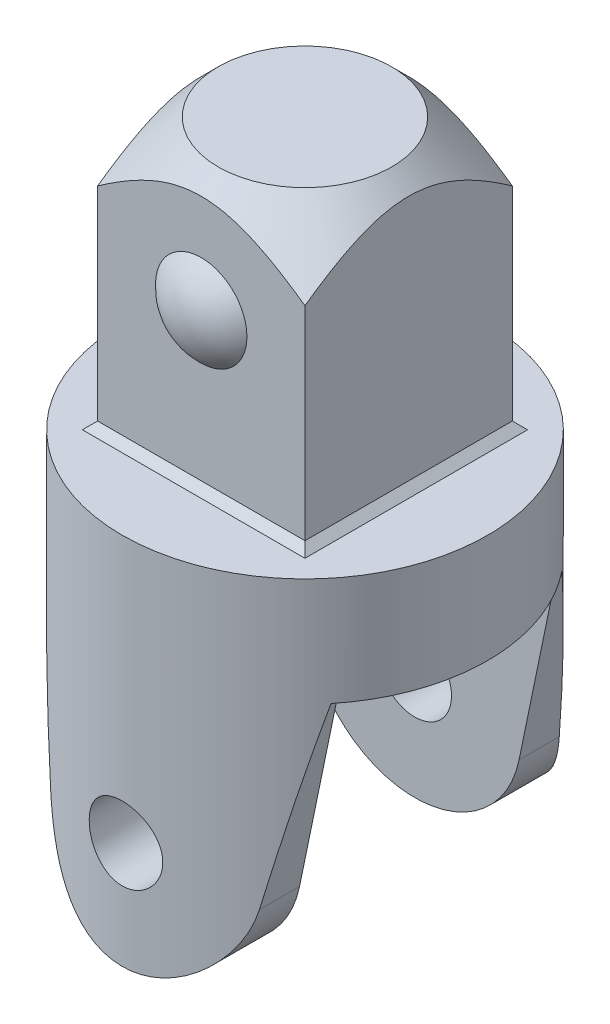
ISO-10303-21;
HEADER;
FILE_DESCRIPTION(('STEP AP214'),'2;1');
FILE_NAME('part.step','',(''),(''),'','','');
FILE_SCHEMA(('AUTOMOTIVE_DESIGN { 1 0 10303 214 1 1 1 1 }'));
ENDSEC;
DATA;
#1=APPLICATION_CONTEXT('core data for automotive mechanical design processes');
#2=APPLICATION_PROTOCOL_DEFINITION('international standard','automotive_design',2000,#1);
#3=PRODUCT_CONTEXT('',#1,'mechanical');
#4=PRODUCT('Part','Part','',(#3));
#5=PRODUCT_RELATED_PRODUCT_CATEGORY('part','',(#4));
#6=PRODUCT_DEFINITION_FORMATION('','',#4);
#7=PRODUCT_DEFINITION_CONTEXT('part definition',#1,'design');
#8=PRODUCT_DEFINITION('design','',#6,#7);
#9=PRODUCT_DEFINITION_SHAPE('','',#8);
#10=(LENGTH_UNIT() NAMED_UNIT(*) SI_UNIT(.MILLI.,.METRE.));
#11=(NAMED_UNIT(*) PLANE_ANGLE_UNIT() SI_UNIT($,.RADIAN.));
#12=(NAMED_UNIT(*) SI_UNIT($,.STERADIAN.) SOLID_ANGLE_UNIT());
#13=UNCERTAINTY_MEASURE_WITH_UNIT(LENGTH_MEASURE(1.E-05),#10,'distance_accuracy_value','');
#14=(GEOMETRIC_REPRESENTATION_CONTEXT(3) GLOBAL_UNCERTAINTY_ASSIGNED_CONTEXT((#13)) GLOBAL_UNIT_ASSIGNED_CONTEXT((#10,
#11,#12)) REPRESENTATION_CONTEXT('',''));
#15=CARTESIAN_POINT('',(0.,0.,0.));
#16=DIRECTION('',(0.,0.,1.));
#17=DIRECTION('',(1.,0.,0.));
#18=AXIS2_PLACEMENT_3D('',#15,#16,#17);
#19=CARTESIAN_POINT('',(6.81,42.33,-6.81));
#20=DIRECTION('',(-1.,0.,0.));
#21=DIRECTION('',(0.,0.,1.));
#22=AXIS2_PLACEMENT_3D('',#19,#20,#21);
#23=PLANE('',#22);
#24=DIRECTION('',(0.,-1.,0.));
#25=VECTOR('',#24,1.);
#26=CARTESIAN_POINT('',(6.81,42.33,6.81));
#27=LINE('',#26,#25);
#28=CARTESIAN_POINT('',(6.81,38.3992056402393,6.81));
#29=VERTEX_POINT('',#28);
#30=CARTESIAN_POINT('',(6.81,25.03,6.81));
#31=VERTEX_POINT('',#30);
#32=EDGE_CURVE('E176',#29,#31,#27,.T.);
#33=ORIENTED_EDGE('',*,*,#32,.T.);
#34=DIRECTION('',(0.,0.,-1.));
#35=VECTOR('',#34,1.);
#36=CARTESIAN_POINT('',(6.81,25.03,-6.81));
#37=LINE('',#36,#35);
#38=CARTESIAN_POINT('',(6.81,25.03,-6.81));
#39=VERTEX_POINT('',#38);
#40=EDGE_CURVE('E368',#31,#39,#37,.T.);
#41=ORIENTED_EDGE('',*,*,#40,.T.);
#42=DIRECTION('',(0.,-1.,0.));
#43=VECTOR('',#42,1.);
#44=CARTESIAN_POINT('',(6.81,42.33,-6.81));
#45=LINE('',#44,#43);
#46=CARTESIAN_POINT('',(6.81,38.3992056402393,-6.81));
#47=VERTEX_POINT('',#46);
#48=EDGE_CURVE('E179',#47,#39,#45,.T.);
#49=ORIENTED_EDGE('',*,*,#48,.F.);
#50=CARTESIAN_POINT('',(6.81,24.6980048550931,22.316045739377));
#51=CARTESIAN_POINT('',(6.81,25.0917937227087,21.9043142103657));
#52=CARTESIAN_POINT('',(6.81,25.4851128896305,21.4921323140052));
#53=CARTESIAN_POINT('',(6.81,26.2706061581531,20.6666735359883));
#54=CARTESIAN_POINT('',(6.81,26.6627802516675,20.2533966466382));
#55=CARTESIAN_POINT('',(6.81,27.4458731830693,19.4254526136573));
#56=CARTESIAN_POINT('',(6.81,27.8367916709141,19.010785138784));
#57=CARTESIAN_POINT('',(6.81,28.6169908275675,18.1799134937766));
#58=CARTESIAN_POINT('',(6.81,29.0062715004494,17.7637093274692));
#59=CARTESIAN_POINT('',(6.81,29.7847323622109,16.9274087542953));
#60=CARTESIAN_POINT('',(6.81,30.1739027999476,16.5073032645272));
#61=CARTESIAN_POINT('',(6.81,30.9497496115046,15.6647961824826));
#62=CARTESIAN_POINT('',(6.81,31.3364259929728,15.2423945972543));
#63=CARTESIAN_POINT('',(6.81,32.1065980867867,14.3947901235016));
#64=CARTESIAN_POINT('',(6.81,32.4900941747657,13.9695875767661));
#65=CARTESIAN_POINT('',(6.81,33.2530582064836,13.1155900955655));
#66=CARTESIAN_POINT('',(6.81,33.6325262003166,12.6867952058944));
#67=CARTESIAN_POINT('',(6.81,34.4119363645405,11.7951608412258));
#68=CARTESIAN_POINT('',(6.81,34.811507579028,11.3319957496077));
#69=CARTESIAN_POINT('',(6.81,35.4046720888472,10.6319350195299));
#70=CARTESIAN_POINT('',(6.81,35.6013776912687,10.3976761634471));
#71=CARTESIAN_POINT('',(6.81,35.9923036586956,9.92709562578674));
#72=CARTESIAN_POINT('',(6.81,36.1865240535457,9.69077396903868));
#73=CARTESIAN_POINT('',(6.81,36.5719003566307,9.21581284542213));
#74=CARTESIAN_POINT('',(6.81,36.7630575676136,8.97717443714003));
#75=CARTESIAN_POINT('',(6.81,37.1417470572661,8.49704320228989));
#76=CARTESIAN_POINT('',(6.81,37.3292794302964,8.25555045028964));
#77=CARTESIAN_POINT('',(6.81,37.6998483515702,7.76921744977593));
#78=CARTESIAN_POINT('',(6.81,37.8828859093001,7.52437797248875));
#79=CARTESIAN_POINT('',(6.81,38.2433958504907,7.03064600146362));
#80=CARTESIAN_POINT('',(6.81,38.4208685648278,6.78175375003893));
#81=CARTESIAN_POINT('',(6.81,38.7763923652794,6.26809646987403));
#82=CARTESIAN_POINT('',(6.81,38.9541297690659,6.00311312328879));
#83=CARTESIAN_POINT('',(6.81,39.2996850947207,5.4666658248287));
#84=CARTESIAN_POINT('',(6.81,39.4675015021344,5.195200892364));
#85=CARTESIAN_POINT('',(6.81,39.7900097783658,4.64447527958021));
#86=CARTESIAN_POINT('',(6.81,39.9447015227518,4.3652145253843));
#87=CARTESIAN_POINT('',(6.81,40.2364336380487,3.79774747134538));
#88=CARTESIAN_POINT('',(6.81,40.3734800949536,3.50954429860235));
#89=CARTESIAN_POINT('',(6.81,40.6751310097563,2.80305072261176));
#90=CARTESIAN_POINT('',(6.81,40.8282594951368,2.37954352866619));
#91=CARTESIAN_POINT('',(6.81,41.0065343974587,1.73089388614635));
#92=CARTESIAN_POINT('',(6.81,41.0573531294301,1.5127715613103));
#93=CARTESIAN_POINT('',(6.81,41.1393984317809,1.07281488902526));
#94=CARTESIAN_POINT('',(6.81,41.1706274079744,0.85098100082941));
#95=CARTESIAN_POINT('',(6.81,41.2117924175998,0.402735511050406));
#96=CARTESIAN_POINT('',(6.81,41.2214792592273,0.176300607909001));
#97=CARTESIAN_POINT('',(6.81,41.218152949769,-0.276394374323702));
#98=CARTESIAN_POINT('',(6.81,41.2051402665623,-0.502654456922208));
#99=CARTESIAN_POINT('',(6.81,41.1572714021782,-0.953204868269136));
#100=CARTESIAN_POINT('',(6.81,41.1223775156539,-1.17749111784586));
#101=CARTESIAN_POINT('',(6.81,41.0328767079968,-1.62207226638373));
#102=CARTESIAN_POINT('',(6.81,40.9782648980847,-1.8423661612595));
#103=CARTESIAN_POINT('',(6.81,40.8245855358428,-2.37310763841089));
#104=CARTESIAN_POINT('',(6.81,40.7165183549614,-2.68093446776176));
#105=CARTESIAN_POINT('',(6.81,40.4738019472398,-3.28588835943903));
#106=CARTESIAN_POINT('',(6.81,40.3391343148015,-3.58300784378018));
#107=CARTESIAN_POINT('',(6.81,40.1220023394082,-4.02200649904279));
#108=CARTESIAN_POINT('',(6.81,40.0468855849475,-4.16760000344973));
#109=CARTESIAN_POINT('',(6.81,39.8923421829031,-4.45648820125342));
#110=CARTESIAN_POINT('',(6.81,39.8129154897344,-4.59978287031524));
#111=CARTESIAN_POINT('',(6.81,39.650393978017,-4.88418974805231));
#112=CARTESIAN_POINT('',(6.81,39.5673006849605,-5.02530283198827));
#113=CARTESIAN_POINT('',(6.81,39.3979162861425,-5.30558322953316));
#114=CARTESIAN_POINT('',(6.81,39.3116253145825,-5.44475062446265));
#115=CARTESIAN_POINT('',(6.81,39.018538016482,-5.90705845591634));
#116=CARTESIAN_POINT('',(6.81,38.8055377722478,-6.22627212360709));
#117=CARTESIAN_POINT('',(6.81,38.3685179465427,-6.85709485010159));
#118=CARTESIAN_POINT('',(6.81,38.1444956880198,-7.16870203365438));
#119=CARTESIAN_POINT('',(6.81,37.6880510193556,-7.78607869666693));
#120=CARTESIAN_POINT('',(6.81,37.4556218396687,-8.09184315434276));
#121=CARTESIAN_POINT('',(6.81,36.984513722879,-8.69845577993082));
#122=CARTESIAN_POINT('',(6.81,36.7458353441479,-8.99930438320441));
#123=CARTESIAN_POINT('',(6.81,36.2629684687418,-9.59782565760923));
#124=CARTESIAN_POINT('',(6.81,36.0187672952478,-9.89548807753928));
#125=CARTESIAN_POINT('',(6.81,35.5264679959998,-10.4875756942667));
#126=CARTESIAN_POINT('',(6.81,35.2783697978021,-10.7820008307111));
#127=CARTESIAN_POINT('',(6.81,34.7791543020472,-11.368040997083));
#128=CARTESIAN_POINT('',(6.81,34.5280384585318,-11.6596572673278));
#129=CARTESIAN_POINT('',(6.81,34.0232413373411,-12.2406625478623));
#130=CARTESIAN_POINT('',(6.81,33.7695600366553,-12.5300515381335));
#131=CARTESIAN_POINT('',(6.81,33.0047193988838,-13.3961473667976));
#132=CARTESIAN_POINT('',(6.81,32.4903889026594,-13.9700534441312));
#133=CARTESIAN_POINT('',(6.81,31.4557352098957,-15.1125293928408));
#134=CARTESIAN_POINT('',(6.81,30.9354113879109,-15.6810986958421));
#135=CARTESIAN_POINT('',(6.81,29.891054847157,-16.8134778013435));
#136=CARTESIAN_POINT('',(6.81,29.3670276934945,-17.3772927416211));
#137=CARTESIAN_POINT('',(6.81,28.3156784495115,-18.5018416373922));
#138=CARTESIAN_POINT('',(6.81,27.7883563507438,-19.0625755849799));
#139=CARTESIAN_POINT('',(6.81,27.0468305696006,-19.8474865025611));
#140=CARTESIAN_POINT('',(6.81,26.8336965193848,-20.0726753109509));
#141=CARTESIAN_POINT('',(6.81,26.4070146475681,-20.5227320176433));
#142=CARTESIAN_POINT('',(6.81,26.1934667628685,-20.7475998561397));
#143=CARTESIAN_POINT('',(6.81,25.7664282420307,-21.1965875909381));
#144=CARTESIAN_POINT('',(6.81,25.55293824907,-21.4207080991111));
#145=CARTESIAN_POINT('',(6.81,25.1256810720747,-21.8686128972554));
#146=CARTESIAN_POINT('',(6.81,24.9119139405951,-22.092397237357));
#147=CARTESIAN_POINT('',(6.81,24.6980048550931,-22.316045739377));
#148=B_SPLINE_CURVE_WITH_KNOTS('',3,(#50,#51,#52,#53,#54,#55,#56,#57,#58,#59,#60,#61,#62,#63,
#64,#65,#66,#67,#68,#69,#70,#71,#72,#73,#74,#75,#76,#77,#78,#79,#80,#81,#82,#83,#84,#85,#86,#87,
#88,#89,#90,#91,#92,#93,#94,#95,#96,#97,#98,#99,#100,#101,#102,#103,#104,#105,#106,#107,#108,
#109,#110,#111,#112,#113,#114,#115,#116,#117,#118,#119,#120,#121,#122,#123,#124,#125,#126,#127,
#128,#129,#130,#131,#132,#133,#134,#135,#136,#137,#138,#139,#140,#141,#142,#143,#144,#145,#146,
#147),.UNSPECIFIED.,.F.,.F.,(4,2,2,2,2,2,2,2,2,2,2,2,2,2,2,2,2,2,2,2,2,2,2,2,2,2,2,2,2,2,2,2,2,
2,2,2,2,2,2,2,2,2,2,2,2,2,2,2,4),(0.,1.70919151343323,3.41839506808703,5.12803969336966,
6.8376800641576,8.55565922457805,10.2736331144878,11.9914011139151,13.7091477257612,
15.5441707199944,16.4618353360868,17.3794889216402,18.2967412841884,19.2139697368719,
20.1309902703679,21.0479561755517,22.0049959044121,22.9621813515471,23.9193758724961,
24.876239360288,26.2224377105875,26.893594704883,27.5646692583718,28.2434670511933,
28.9222508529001,29.6022075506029,30.2823329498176,31.2593313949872,32.2370082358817,
32.7284385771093,33.2198741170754,33.7111070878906,34.2023194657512,35.3532130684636,
36.5043875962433,37.6565106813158,38.8085311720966,39.9635371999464,41.1185647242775,
42.2730563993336,43.4275584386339,45.7394454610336,48.0515759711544,50.3607629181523,
52.669955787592,53.6001302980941,54.5304599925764,55.4590456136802,56.3874753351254),.UNSPECIFIED.);
#149=EDGE_CURVE('E168',#29,#47,#148,.T.);
#150=ORIENTED_EDGE('',*,*,#149,.F.);
#151=EDGE_LOOP('',(#33,#41,#49,#150));
#152=FACE_BOUND('',#151,.T.);
#153=ADVANCED_FACE('F62',(#152),#23,.F.);
#154=CARTESIAN_POINT('',(-6.81,42.33,-6.81));
#155=DIRECTION('',(0.,0.,1.));
#156=DIRECTION('',(1.,0.,0.));
#157=AXIS2_PLACEMENT_3D('',#154,#155,#156);
#158=PLANE('',#157);
#159=CARTESIAN_POINT('',(0.,34.73,-6.81));
#160=DIRECTION('',(0.,0.,1.));
#161=DIRECTION('',(1.,0.,0.));
#162=AXIS2_PLACEMENT_3D('',#159,#160,#161);
#163=CIRCLE('',#162,3.);
#164=CARTESIAN_POINT('',(3.,34.73,-6.81));
#165=VERTEX_POINT('',#164);
#166=EDGE_CURVE('E374',#165,#165,#163,.T.);
#167=ORIENTED_EDGE('',*,*,#166,.T.);
#168=EDGE_LOOP('',(#167));
#169=FACE_BOUND('',#168,.T.);
#170=ORIENTED_EDGE('',*,*,#48,.T.);
#171=DIRECTION('',(-1.,0.,0.));
#172=VECTOR('',#171,1.);
#173=CARTESIAN_POINT('',(-6.81,25.03,-6.81));
#174=LINE('',#173,#172);
#175=CARTESIAN_POINT('',(-6.81,25.03,-6.81));
#176=VERTEX_POINT('',#175);
#177=EDGE_CURVE('E356',#39,#176,#174,.T.);
#178=ORIENTED_EDGE('',*,*,#177,.T.);
#179=DIRECTION('',(0.,-1.,0.));
#180=VECTOR('',#179,1.);
#181=CARTESIAN_POINT('',(-6.81,42.33,-6.81));
#182=LINE('',#181,#180);
#183=CARTESIAN_POINT('',(-6.81,38.3992056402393,-6.81));
#184=VERTEX_POINT('',#183);
#185=EDGE_CURVE('E185',#184,#176,#182,.T.);
#186=ORIENTED_EDGE('',*,*,#185,.F.);
#187=CARTESIAN_POINT('',(22.316045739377,24.6980048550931,-6.81));
#188=CARTESIAN_POINT('',(21.9043142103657,25.0917937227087,-6.81));
#189=CARTESIAN_POINT('',(21.4921323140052,25.4851128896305,-6.81));
#190=CARTESIAN_POINT('',(20.6666735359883,26.2706061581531,-6.81));
#191=CARTESIAN_POINT('',(20.2533966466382,26.6627802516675,-6.81));
#192=CARTESIAN_POINT('',(19.4254526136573,27.4458731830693,-6.81));
#193=CARTESIAN_POINT('',(19.010785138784,27.8367916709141,-6.81));
#194=CARTESIAN_POINT('',(18.1799134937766,28.6169908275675,-6.81));
#195=CARTESIAN_POINT('',(17.7637093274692,29.0062715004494,-6.81));
#196=CARTESIAN_POINT('',(16.9274087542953,29.7847323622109,-6.81));
#197=CARTESIAN_POINT('',(16.5073032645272,30.1739027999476,-6.81));
#198=CARTESIAN_POINT('',(15.6647961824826,30.9497496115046,-6.81));
#199=CARTESIAN_POINT('',(15.2423945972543,31.3364259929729,-6.81));
#200=CARTESIAN_POINT('',(14.3947901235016,32.1065980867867,-6.81));
#201=CARTESIAN_POINT('',(13.9695875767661,32.4900941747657,-6.81));
#202=CARTESIAN_POINT('',(13.1155900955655,33.2530582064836,-6.81));
#203=CARTESIAN_POINT('',(12.6867952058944,33.6325262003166,-6.81));
#204=CARTESIAN_POINT('',(11.7951608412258,34.4119363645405,-6.81));
#205=CARTESIAN_POINT('',(11.3319957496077,34.811507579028,-6.81));
#206=CARTESIAN_POINT('',(10.6319350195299,35.4046720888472,-6.81));
#207=CARTESIAN_POINT('',(10.3976761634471,35.6013776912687,-6.81));
#208=CARTESIAN_POINT('',(9.92709562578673,35.9923036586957,-6.81));
#209=CARTESIAN_POINT('',(9.69077396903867,36.1865240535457,-6.81));
#210=CARTESIAN_POINT('',(9.21581284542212,36.5719003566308,-6.81));
#211=CARTESIAN_POINT('',(8.97717443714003,36.7630575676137,-6.81));
#212=CARTESIAN_POINT('',(8.49704320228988,37.1417470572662,-6.81));
#213=CARTESIAN_POINT('',(8.25555045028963,37.3292794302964,-6.81));
#214=CARTESIAN_POINT('',(7.76921744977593,37.6998483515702,-6.81));
#215=CARTESIAN_POINT('',(7.52437797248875,37.8828859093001,-6.81));
#216=CARTESIAN_POINT('',(7.03064600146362,38.2433958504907,-6.81));
#217=CARTESIAN_POINT('',(6.78175375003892,38.4208685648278,-6.81));
#218=CARTESIAN_POINT('',(6.26809646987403,38.7763923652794,-6.81));
#219=CARTESIAN_POINT('',(6.00311312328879,38.9541297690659,-6.81));
#220=CARTESIAN_POINT('',(5.4666658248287,39.2996850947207,-6.81));
#221=CARTESIAN_POINT('',(5.195200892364,39.4675015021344,-6.81));
#222=CARTESIAN_POINT('',(4.64447527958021,39.7900097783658,-6.81));
#223=CARTESIAN_POINT('',(4.3652145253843,39.9447015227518,-6.81));
#224=CARTESIAN_POINT('',(3.79774747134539,40.2364336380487,-6.81));
#225=CARTESIAN_POINT('',(3.50954429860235,40.3734800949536,-6.81));
#226=CARTESIAN_POINT('',(2.80305072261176,40.6751310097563,-6.81));
#227=CARTESIAN_POINT('',(2.37954352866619,40.8282594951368,-6.81));
#228=CARTESIAN_POINT('',(1.73089388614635,41.0065343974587,-6.81));
#229=CARTESIAN_POINT('',(1.51277156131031,41.0573531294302,-6.81));
#230=CARTESIAN_POINT('',(1.07281488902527,41.1393984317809,-6.81));
#231=CARTESIAN_POINT('',(0.85098100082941,41.1706274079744,-6.81));
#232=CARTESIAN_POINT('',(0.402735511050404,41.2117924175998,-6.81));
#233=CARTESIAN_POINT('',(0.176300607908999,41.2214792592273,-6.81));
#234=CARTESIAN_POINT('',(-0.276394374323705,41.218152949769,-6.81));
#235=CARTESIAN_POINT('',(-0.502654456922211,41.2051402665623,-6.81));
#236=CARTESIAN_POINT('',(-0.953204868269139,41.1572714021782,-6.81));
#237=CARTESIAN_POINT('',(-1.17749111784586,41.1223775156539,-6.81));
#238=CARTESIAN_POINT('',(-1.62207226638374,41.0328767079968,-6.81));
#239=CARTESIAN_POINT('',(-1.8423661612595,40.9782648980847,-6.81));
#240=CARTESIAN_POINT('',(-2.3731076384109,40.8245855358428,-6.81));
#241=CARTESIAN_POINT('',(-2.68093446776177,40.7165183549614,-6.81));
#242=CARTESIAN_POINT('',(-3.28588835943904,40.4738019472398,-6.81));
#243=CARTESIAN_POINT('',(-3.58300784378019,40.3391343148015,-6.81));
#244=CARTESIAN_POINT('',(-4.02200649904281,40.1220023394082,-6.81));
#245=CARTESIAN_POINT('',(-4.16760000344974,40.0468855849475,-6.81));
#246=CARTESIAN_POINT('',(-4.45648820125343,39.8923421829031,-6.81));
#247=CARTESIAN_POINT('',(-4.59978287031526,39.8129154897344,-6.81));
#248=CARTESIAN_POINT('',(-4.88418974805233,39.650393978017,-6.81));
#249=CARTESIAN_POINT('',(-5.02530283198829,39.5673006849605,-6.81));
#250=CARTESIAN_POINT('',(-5.30558322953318,39.3979162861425,-6.81));
#251=CARTESIAN_POINT('',(-5.44475062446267,39.3116253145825,-6.81));
#252=CARTESIAN_POINT('',(-5.90705845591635,39.018538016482,-6.81));
#253=CARTESIAN_POINT('',(-6.2262721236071,38.8055377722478,-6.81));
#254=CARTESIAN_POINT('',(-6.85709485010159,38.3685179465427,-6.81));
#255=CARTESIAN_POINT('',(-7.16870203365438,38.1444956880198,-6.81));
#256=CARTESIAN_POINT('',(-7.78607869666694,37.6880510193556,-6.81));
#257=CARTESIAN_POINT('',(-8.09184315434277,37.4556218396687,-6.81));
#258=CARTESIAN_POINT('',(-8.69845577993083,36.984513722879,-6.81));
#259=CARTESIAN_POINT('',(-8.99930438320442,36.7458353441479,-6.81));
#260=CARTESIAN_POINT('',(-9.59782565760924,36.2629684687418,-6.81));
#261=CARTESIAN_POINT('',(-9.89548807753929,36.0187672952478,-6.81));
#262=CARTESIAN_POINT('',(-10.4875756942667,35.5264679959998,-6.81));
#263=CARTESIAN_POINT('',(-10.7820008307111,35.2783697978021,-6.81));
#264=CARTESIAN_POINT('',(-11.368040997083,34.7791543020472,-6.81));
#265=CARTESIAN_POINT('',(-11.6596572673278,34.5280384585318,-6.81));
#266=CARTESIAN_POINT('',(-12.2406625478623,34.0232413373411,-6.81));
#267=CARTESIAN_POINT('',(-12.5300515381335,33.7695600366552,-6.81));
#268=CARTESIAN_POINT('',(-13.3961473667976,33.0047193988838,-6.81));
#269=CARTESIAN_POINT('',(-13.9700534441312,32.4903889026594,-6.81));
#270=CARTESIAN_POINT('',(-15.1125293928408,31.4557352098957,-6.81));
#271=CARTESIAN_POINT('',(-15.6810986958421,30.9354113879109,-6.81));
#272=CARTESIAN_POINT('',(-16.8134778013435,29.891054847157,-6.81));
#273=CARTESIAN_POINT('',(-17.3772927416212,29.3670276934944,-6.81));
#274=CARTESIAN_POINT('',(-18.5018416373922,28.3156784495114,-6.81));
#275=CARTESIAN_POINT('',(-19.06257558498,27.7883563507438,-6.81));
#276=CARTESIAN_POINT('',(-19.8474865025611,27.0468305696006,-6.81));
#277=CARTESIAN_POINT('',(-20.0726753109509,26.8336965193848,-6.81));
#278=CARTESIAN_POINT('',(-20.5227320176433,26.407014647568,-6.81));
#279=CARTESIAN_POINT('',(-20.7475998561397,26.1934667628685,-6.81));
#280=CARTESIAN_POINT('',(-21.1965875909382,25.7664282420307,-6.81));
#281=CARTESIAN_POINT('',(-21.4207080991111,25.55293824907,-6.81));
#282=CARTESIAN_POINT('',(-21.8686128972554,25.1256810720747,-6.81));
#283=CARTESIAN_POINT('',(-22.092397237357,24.9119139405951,-6.81));
#284=CARTESIAN_POINT('',(-22.316045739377,24.6980048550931,-6.81));
#285=B_SPLINE_CURVE_WITH_KNOTS('',3,(#187,#188,#189,#190,#191,#192,#193,#194,#195,#196,#197,
#198,#199,#200,#201,#202,#203,#204,#205,#206,#207,#208,#209,#210,#211,#212,#213,#214,#215,#216,
#217,#218,#219,#220,#221,#222,#223,#224,#225,#226,#227,#228,#229,#230,#231,#232,#233,#234,#235,
#236,#237,#238,#239,#240,#241,#242,#243,#244,#245,#246,#247,#248,#249,#250,#251,#252,#253,#254,
#255,#256,#257,#258,#259,#260,#261,#262,#263,#264,#265,#266,#267,#268,#269,#270,#271,#272,#273,
#274,#275,#276,#277,#278,#279,#280,#281,#282,#283,#284),.UNSPECIFIED.,.F.,.F.,(4,2,2,2,2,2,2,2,
2,2,2,2,2,2,2,2,2,2,2,2,2,2,2,2,2,2,2,2,2,2,2,2,2,2,2,2,2,2,2,2,2,2,2,2,2,2,2,2,4),(0.,
1.70919151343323,3.41839506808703,5.12803969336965,6.8376800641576,8.55565922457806,
10.2736331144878,11.9914011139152,13.7091477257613,15.5441707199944,16.4618353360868,
17.3794889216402,18.2967412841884,19.2139697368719,20.130990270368,21.0479561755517,
22.0049959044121,22.9621813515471,23.9193758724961,24.876239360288,26.2224377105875,
26.893594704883,27.5646692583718,28.2434670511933,28.9222508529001,29.6022075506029,
30.2823329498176,31.2593313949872,32.2370082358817,32.7284385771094,33.2198741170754,
33.7111070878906,34.2023194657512,35.3532130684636,36.5043875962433,37.6565106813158,
38.8085311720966,39.9635371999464,41.1185647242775,42.2730563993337,43.427558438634,
45.7394454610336,48.0515759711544,50.3607629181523,52.6699557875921,53.6001302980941,
54.5304599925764,55.4590456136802,56.3874753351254),.UNSPECIFIED.);
#286=EDGE_CURVE('E180',#47,#184,#285,.T.);
#287=ORIENTED_EDGE('',*,*,#286,.F.);
#288=EDGE_LOOP('',(#170,#178,#186,#287));
#289=FACE_BOUND('',#288,.T.);
#290=ADVANCED_FACE('F283',(#169,#289),#158,.F.);
#291=CARTESIAN_POINT('',(-6.81,42.33,-6.81));
#292=DIRECTION('',(1.,0.,0.));
#293=DIRECTION('',(0.,0.,-1.));
#294=AXIS2_PLACEMENT_3D('',#291,#292,#293);
#295=PLANE('',#294);
#296=ORIENTED_EDGE('',*,*,#185,.T.);
#297=DIRECTION('',(0.,0.,1.));
#298=VECTOR('',#297,1.);
#299=CARTESIAN_POINT('',(-6.81,25.03,-6.81));
#300=LINE('',#299,#298);
#301=CARTESIAN_POINT('',(-6.81,25.03,6.81));
#302=VERTEX_POINT('',#301);
#303=EDGE_CURVE('E72',#176,#302,#300,.T.);
#304=ORIENTED_EDGE('',*,*,#303,.T.);
#305=DIRECTION('',(0.,-1.,0.));
#306=VECTOR('',#305,1.);
#307=CARTESIAN_POINT('',(-6.81,42.33,6.81));
#308=LINE('',#307,#306);
#309=CARTESIAN_POINT('',(-6.81,38.3992056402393,6.81));
#310=VERTEX_POINT('',#309);
#311=EDGE_CURVE('E183',#310,#302,#308,.T.);
#312=ORIENTED_EDGE('',*,*,#311,.F.);
#313=CARTESIAN_POINT('',(-6.81,24.6980048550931,-22.316045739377));
#314=CARTESIAN_POINT('',(-6.81,25.0917937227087,-21.9043142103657));
#315=CARTESIAN_POINT('',(-6.81,25.4851128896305,-21.4921323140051));
#316=CARTESIAN_POINT('',(-6.81,26.2706061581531,-20.6666735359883));
#317=CARTESIAN_POINT('',(-6.81,26.6627802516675,-20.2533966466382));
#318=CARTESIAN_POINT('',(-6.81,27.4458731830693,-19.4254526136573));
#319=CARTESIAN_POINT('',(-6.81,27.8367916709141,-19.010785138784));
#320=CARTESIAN_POINT('',(-6.81,28.6169908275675,-18.1799134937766));
#321=CARTESIAN_POINT('',(-6.81,29.0062715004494,-17.7637093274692));
#322=CARTESIAN_POINT('',(-6.81,29.7847323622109,-16.9274087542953));
#323=CARTESIAN_POINT('',(-6.81,30.1739027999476,-16.5073032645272));
#324=CARTESIAN_POINT('',(-6.81,30.9497496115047,-15.6647961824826));
#325=CARTESIAN_POINT('',(-6.81,31.3364259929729,-15.2423945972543));
#326=CARTESIAN_POINT('',(-6.81,32.1065980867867,-14.3947901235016));
#327=CARTESIAN_POINT('',(-6.81,32.4900941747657,-13.9695875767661));
#328=CARTESIAN_POINT('',(-6.81,33.2530582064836,-13.1155900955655));
#329=CARTESIAN_POINT('',(-6.81,33.6325262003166,-12.6867952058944));
#330=CARTESIAN_POINT('',(-6.81,34.4119363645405,-11.7951608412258));
#331=CARTESIAN_POINT('',(-6.81,34.811507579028,-11.3319957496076));
#332=CARTESIAN_POINT('',(-6.81,35.4046720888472,-10.6319350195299));
#333=CARTESIAN_POINT('',(-6.81,35.6013776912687,-10.3976761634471));
#334=CARTESIAN_POINT('',(-6.81,35.9923036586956,-9.92709562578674));
#335=CARTESIAN_POINT('',(-6.81,36.1865240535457,-9.69077396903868));
#336=CARTESIAN_POINT('',(-6.81,36.5719003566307,-9.21581284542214));
#337=CARTESIAN_POINT('',(-6.81,36.7630575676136,-8.97717443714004));
#338=CARTESIAN_POINT('',(-6.81,37.1417470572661,-8.4970432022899));
#339=CARTESIAN_POINT('',(-6.81,37.3292794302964,-8.25555045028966));
#340=CARTESIAN_POINT('',(-6.81,37.6998483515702,-7.76921744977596));
#341=CARTESIAN_POINT('',(-6.81,37.8828859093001,-7.52437797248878));
#342=CARTESIAN_POINT('',(-6.81,38.2433958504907,-7.03064600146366));
#343=CARTESIAN_POINT('',(-6.81,38.4208685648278,-6.78175375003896));
#344=CARTESIAN_POINT('',(-6.81,38.7763923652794,-6.26809646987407));
#345=CARTESIAN_POINT('',(-6.81,38.9541297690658,-6.00311312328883));
#346=CARTESIAN_POINT('',(-6.81,39.2996850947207,-5.46666582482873));
#347=CARTESIAN_POINT('',(-6.81,39.4675015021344,-5.19520089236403));
#348=CARTESIAN_POINT('',(-6.81,39.7900097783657,-4.64447527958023));
#349=CARTESIAN_POINT('',(-6.81,39.9447015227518,-4.36521452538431));
#350=CARTESIAN_POINT('',(-6.81,40.2364336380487,-3.79774747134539));
#351=CARTESIAN_POINT('',(-6.81,40.3734800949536,-3.50954429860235));
#352=CARTESIAN_POINT('',(-6.81,40.6751310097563,-2.80305072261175));
#353=CARTESIAN_POINT('',(-6.81,40.8282594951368,-2.37954352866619));
#354=CARTESIAN_POINT('',(-6.81,41.0065343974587,-1.73089388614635));
#355=CARTESIAN_POINT('',(-6.81,41.0573531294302,-1.5127715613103));
#356=CARTESIAN_POINT('',(-6.81,41.1393984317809,-1.07281488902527));
#357=CARTESIAN_POINT('',(-6.81,41.1706274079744,-0.850981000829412));
#358=CARTESIAN_POINT('',(-6.81,41.2117924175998,-0.402735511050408));
#359=CARTESIAN_POINT('',(-6.81,41.2214792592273,-0.176300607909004));
#360=CARTESIAN_POINT('',(-6.81,41.218152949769,0.276394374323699));
#361=CARTESIAN_POINT('',(-6.81,41.2051402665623,0.502654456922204));
#362=CARTESIAN_POINT('',(-6.81,41.1572714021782,0.95320486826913));
#363=CARTESIAN_POINT('',(-6.81,41.1223775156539,1.17749111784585));
#364=CARTESIAN_POINT('',(-6.81,41.0328767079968,1.62207226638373));
#365=CARTESIAN_POINT('',(-6.81,40.9782648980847,1.84236616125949));
#366=CARTESIAN_POINT('',(-6.81,40.8245855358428,2.37310763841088));
#367=CARTESIAN_POINT('',(-6.81,40.7165183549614,2.68093446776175));
#368=CARTESIAN_POINT('',(-6.81,40.4738019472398,3.28588835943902));
#369=CARTESIAN_POINT('',(-6.81,40.3391343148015,3.58300784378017));
#370=CARTESIAN_POINT('',(-6.81,40.1220023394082,4.02200649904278));
#371=CARTESIAN_POINT('',(-6.81,40.0468855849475,4.16760000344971));
#372=CARTESIAN_POINT('',(-6.81,39.8923421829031,4.4564882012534));
#373=CARTESIAN_POINT('',(-6.81,39.8129154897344,4.59978287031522));
#374=CARTESIAN_POINT('',(-6.81,39.650393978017,4.8841897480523));
#375=CARTESIAN_POINT('',(-6.81,39.5673006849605,5.02530283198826));
#376=CARTESIAN_POINT('',(-6.81,39.3979162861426,5.30558322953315));
#377=CARTESIAN_POINT('',(-6.81,39.3116253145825,5.44475062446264));
#378=CARTESIAN_POINT('',(-6.81,39.018538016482,5.90705845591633));
#379=CARTESIAN_POINT('',(-6.81,38.8055377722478,6.22627212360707));
#380=CARTESIAN_POINT('',(-6.81,38.3685179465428,6.85709485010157));
#381=CARTESIAN_POINT('',(-6.81,38.1444956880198,7.16870203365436));
#382=CARTESIAN_POINT('',(-6.81,37.6880510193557,7.78607869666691));
#383=CARTESIAN_POINT('',(-6.81,37.4556218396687,8.09184315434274));
#384=CARTESIAN_POINT('',(-6.81,36.9845137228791,8.6984557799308));
#385=CARTESIAN_POINT('',(-6.81,36.745835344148,8.99930438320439));
#386=CARTESIAN_POINT('',(-6.81,36.2629684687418,9.59782565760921));
#387=CARTESIAN_POINT('',(-6.81,36.0187672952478,9.89548807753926));
#388=CARTESIAN_POINT('',(-6.81,35.5264679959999,10.4875756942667));
#389=CARTESIAN_POINT('',(-6.81,35.2783697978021,10.7820008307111));
#390=CARTESIAN_POINT('',(-6.81,34.7791543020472,11.3680409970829));
#391=CARTESIAN_POINT('',(-6.81,34.5280384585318,11.6596572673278));
#392=CARTESIAN_POINT('',(-6.81,34.0232413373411,12.2406625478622));
#393=CARTESIAN_POINT('',(-6.81,33.7695600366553,12.5300515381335));
#394=CARTESIAN_POINT('',(-6.81,33.0047193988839,13.3961473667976));
#395=CARTESIAN_POINT('',(-6.81,32.4903889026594,13.9700534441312));
#396=CARTESIAN_POINT('',(-6.81,31.4557352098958,15.1125293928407));
#397=CARTESIAN_POINT('',(-6.81,30.935411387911,15.681098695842));
#398=CARTESIAN_POINT('',(-6.81,29.8910548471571,16.8134778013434));
#399=CARTESIAN_POINT('',(-6.81,29.3670276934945,17.3772927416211));
#400=CARTESIAN_POINT('',(-6.81,28.3156784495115,18.5018416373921));
#401=CARTESIAN_POINT('',(-6.81,27.7883563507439,19.0625755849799));
#402=CARTESIAN_POINT('',(-6.81,27.0468305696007,19.847486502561));
#403=CARTESIAN_POINT('',(-6.81,26.8336965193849,20.0726753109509));
#404=CARTESIAN_POINT('',(-6.81,26.4070146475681,20.5227320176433));
#405=CARTESIAN_POINT('',(-6.81,26.1934667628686,20.7475998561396));
#406=CARTESIAN_POINT('',(-6.81,25.7664282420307,21.1965875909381));
#407=CARTESIAN_POINT('',(-6.81,25.55293824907,21.420708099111));
#408=CARTESIAN_POINT('',(-6.81,25.1256810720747,21.8686128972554));
#409=CARTESIAN_POINT('',(-6.81,24.9119139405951,22.092397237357));
#410=CARTESIAN_POINT('',(-6.81,24.6980048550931,22.316045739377));
#411=B_SPLINE_CURVE_WITH_KNOTS('',3,(#313,#314,#315,#316,#317,#318,#319,#320,#321,#322,#323,
#324,#325,#326,#327,#328,#329,#330,#331,#332,#333,#334,#335,#336,#337,#338,#339,#340,#341,#342,
#343,#344,#345,#346,#347,#348,#349,#350,#351,#352,#353,#354,#355,#356,#357,#358,#359,#360,#361,
#362,#363,#364,#365,#366,#367,#368,#369,#370,#371,#372,#373,#374,#375,#376,#377,#378,#379,#380,
#381,#382,#383,#384,#385,#386,#387,#388,#389,#390,#391,#392,#393,#394,#395,#396,#397,#398,#399,
#400,#401,#402,#403,#404,#405,#406,#407,#408,#409,#410),.UNSPECIFIED.,.F.,.F.,(4,2,2,2,2,2,2,2,
2,2,2,2,2,2,2,2,2,2,2,2,2,2,2,2,2,2,2,2,2,2,2,2,2,2,2,2,2,2,2,2,2,2,2,2,2,2,2,2,4),(0.,
1.70919151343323,3.41839506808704,5.12803969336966,6.83768006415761,8.55565922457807,
10.2736331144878,11.9914011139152,13.7091477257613,15.5441707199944,16.4618353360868,
17.3794889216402,18.2967412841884,19.2139697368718,20.1309902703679,21.0479561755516,
22.004995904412,22.9621813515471,23.9193758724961,24.876239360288,26.2224377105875,
26.893594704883,27.5646692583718,28.2434670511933,28.9222508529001,29.6022075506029,
30.2823329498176,31.2593313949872,32.2370082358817,32.7284385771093,33.2198741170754,
33.7111070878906,34.2023194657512,35.3532130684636,36.5043875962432,37.6565106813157,
38.8085311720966,39.9635371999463,41.1185647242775,42.2730563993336,43.4275584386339,
45.7394454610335,48.0515759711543,50.3607629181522,52.6699557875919,53.600130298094,
54.5304599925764,55.4590456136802,56.3874753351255),.UNSPECIFIED.);
#412=EDGE_CURVE('E171',#184,#310,#411,.T.);
#413=ORIENTED_EDGE('',*,*,#412,.F.);
#414=EDGE_LOOP('',(#296,#304,#312,#413));
#415=FACE_BOUND('',#414,.T.);
#416=ADVANCED_FACE('F288',(#415),#295,.F.);
#417=CARTESIAN_POINT('',(-6.81,42.33,6.81));
#418=DIRECTION('',(0.,0.,-1.));
#419=DIRECTION('',(-1.,0.,0.));
#420=AXIS2_PLACEMENT_3D('',#417,#418,#419);
#421=PLANE('',#420);
#422=CARTESIAN_POINT('',(0.,34.73,6.81));
#423=DIRECTION('',(0.,0.,1.));
#424=DIRECTION('',(1.,0.,0.));
#425=AXIS2_PLACEMENT_3D('',#422,#423,#424);
#426=CIRCLE('',#425,3.);
#427=CARTESIAN_POINT('',(3.,34.73,6.81));
#428=VERTEX_POINT('',#427);
#429=EDGE_CURVE('E625',#428,#428,#426,.T.);
#430=ORIENTED_EDGE('',*,*,#429,.F.);
#431=EDGE_LOOP('',(#430));
#432=FACE_BOUND('',#431,.T.);
#433=ORIENTED_EDGE('',*,*,#311,.T.);
#434=DIRECTION('',(1.,0.,0.));
#435=VECTOR('',#434,1.);
#436=CARTESIAN_POINT('',(-6.81,25.03,6.81));
#437=LINE('',#436,#435);
#438=EDGE_CURVE('E12',#302,#31,#437,.T.);
#439=ORIENTED_EDGE('',*,*,#438,.T.);
#440=ORIENTED_EDGE('',*,*,#32,.F.);
#441=CARTESIAN_POINT('',(-22.316045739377,24.6980048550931,6.81));
#442=CARTESIAN_POINT('',(-21.9043142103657,25.0917937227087,6.81));
#443=CARTESIAN_POINT('',(-21.4921323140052,25.4851128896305,6.81));
#444=CARTESIAN_POINT('',(-20.6666735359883,26.2706061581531,6.81));
#445=CARTESIAN_POINT('',(-20.2533966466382,26.6627802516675,6.81));
#446=CARTESIAN_POINT('',(-19.4254526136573,27.4458731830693,6.81));
#447=CARTESIAN_POINT('',(-19.010785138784,27.8367916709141,6.81));
#448=CARTESIAN_POINT('',(-18.1799134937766,28.6169908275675,6.81));
#449=CARTESIAN_POINT('',(-17.7637093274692,29.0062715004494,6.81));
#450=CARTESIAN_POINT('',(-16.9274087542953,29.7847323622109,6.81));
#451=CARTESIAN_POINT('',(-16.5073032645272,30.1739027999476,6.81));
#452=CARTESIAN_POINT('',(-15.6647961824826,30.9497496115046,6.81));
#453=CARTESIAN_POINT('',(-15.2423945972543,31.3364259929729,6.81));
#454=CARTESIAN_POINT('',(-14.3947901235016,32.1065980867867,6.81));
#455=CARTESIAN_POINT('',(-13.9695875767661,32.4900941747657,6.81));
#456=CARTESIAN_POINT('',(-13.1155900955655,33.2530582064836,6.81));
#457=CARTESIAN_POINT('',(-12.6867952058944,33.6325262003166,6.81));
#458=CARTESIAN_POINT('',(-11.7951608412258,34.4119363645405,6.81));
#459=CARTESIAN_POINT('',(-11.3319957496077,34.811507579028,6.81));
#460=CARTESIAN_POINT('',(-10.6319350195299,35.4046720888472,6.81));
#461=CARTESIAN_POINT('',(-10.3976761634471,35.6013776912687,6.81));
#462=CARTESIAN_POINT('',(-9.92709562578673,35.9923036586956,6.81));
#463=CARTESIAN_POINT('',(-9.69077396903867,36.1865240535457,6.81));
#464=CARTESIAN_POINT('',(-9.21581284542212,36.5719003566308,6.81));
#465=CARTESIAN_POINT('',(-8.97717443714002,36.7630575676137,6.81));
#466=CARTESIAN_POINT('',(-8.49704320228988,37.1417470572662,6.81));
#467=CARTESIAN_POINT('',(-8.25555045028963,37.3292794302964,6.81));
#468=CARTESIAN_POINT('',(-7.76921744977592,37.6998483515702,6.81));
#469=CARTESIAN_POINT('',(-7.52437797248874,37.8828859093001,6.81));
#470=CARTESIAN_POINT('',(-7.03064600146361,38.2433958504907,6.81));
#471=CARTESIAN_POINT('',(-6.78175375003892,38.4208685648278,6.81));
#472=CARTESIAN_POINT('',(-6.26809646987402,38.7763923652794,6.81));
#473=CARTESIAN_POINT('',(-6.00311312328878,38.9541297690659,6.81));
#474=CARTESIAN_POINT('',(-5.46666582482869,39.2996850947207,6.81));
#475=CARTESIAN_POINT('',(-5.19520089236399,39.4675015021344,6.81));
#476=CARTESIAN_POINT('',(-4.64447527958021,39.7900097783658,6.81));
#477=CARTESIAN_POINT('',(-4.3652145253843,39.9447015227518,6.81));
#478=CARTESIAN_POINT('',(-3.79774747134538,40.2364336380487,6.81));
#479=CARTESIAN_POINT('',(-3.50954429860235,40.3734800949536,6.81));
#480=CARTESIAN_POINT('',(-2.80305072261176,40.6751310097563,6.81));
#481=CARTESIAN_POINT('',(-2.37954352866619,40.8282594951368,6.81));
#482=CARTESIAN_POINT('',(-1.73089388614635,41.0065343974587,6.81));
#483=CARTESIAN_POINT('',(-1.5127715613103,41.0573531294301,6.81));
#484=CARTESIAN_POINT('',(-1.07281488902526,41.1393984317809,6.81));
#485=CARTESIAN_POINT('',(-0.85098100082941,41.1706274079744,6.81));
#486=CARTESIAN_POINT('',(-0.402735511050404,41.2117924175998,6.81));
#487=CARTESIAN_POINT('',(-0.176300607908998,41.2214792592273,6.81));
#488=CARTESIAN_POINT('',(0.276394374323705,41.218152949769,6.81));
#489=CARTESIAN_POINT('',(0.50265445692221,41.2051402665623,6.81));
#490=CARTESIAN_POINT('',(0.953204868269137,41.1572714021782,6.81));
#491=CARTESIAN_POINT('',(1.17749111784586,41.1223775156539,6.81));
#492=CARTESIAN_POINT('',(1.62207226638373,41.0328767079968,6.81));
#493=CARTESIAN_POINT('',(1.8423661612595,40.9782648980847,6.81));
#494=CARTESIAN_POINT('',(2.3731076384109,40.8245855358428,6.81));
#495=CARTESIAN_POINT('',(2.68093446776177,40.7165183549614,6.81));
#496=CARTESIAN_POINT('',(3.28588835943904,40.4738019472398,6.81));
#497=CARTESIAN_POINT('',(3.58300784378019,40.3391343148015,6.81));
#498=CARTESIAN_POINT('',(4.0220064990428,40.1220023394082,6.81));
#499=CARTESIAN_POINT('',(4.16760000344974,40.0468855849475,6.81));
#500=CARTESIAN_POINT('',(4.45648820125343,39.8923421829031,6.81));
#501=CARTESIAN_POINT('',(4.59978287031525,39.8129154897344,6.81));
#502=CARTESIAN_POINT('',(4.88418974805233,39.650393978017,6.81));
#503=CARTESIAN_POINT('',(5.02530283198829,39.5673006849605,6.81));
#504=CARTESIAN_POINT('',(5.30558322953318,39.3979162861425,6.81));
#505=CARTESIAN_POINT('',(5.44475062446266,39.3116253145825,6.81));
#506=CARTESIAN_POINT('',(5.90705845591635,39.018538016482,6.81));
#507=CARTESIAN_POINT('',(6.2262721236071,38.8055377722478,6.81));
#508=CARTESIAN_POINT('',(6.8570948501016,38.3685179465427,6.81));
#509=CARTESIAN_POINT('',(7.16870203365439,38.1444956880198,6.81));
#510=CARTESIAN_POINT('',(7.78607869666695,37.6880510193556,6.81));
#511=CARTESIAN_POINT('',(8.09184315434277,37.4556218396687,6.81));
#512=CARTESIAN_POINT('',(8.69845577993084,36.984513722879,6.81));
#513=CARTESIAN_POINT('',(8.99930438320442,36.7458353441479,6.81));
#514=CARTESIAN_POINT('',(9.59782565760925,36.2629684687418,6.81));
#515=CARTESIAN_POINT('',(9.8954880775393,36.0187672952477,6.81));
#516=CARTESIAN_POINT('',(10.4875756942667,35.5264679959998,6.81));
#517=CARTESIAN_POINT('',(10.7820008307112,35.2783697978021,6.81));
#518=CARTESIAN_POINT('',(11.368040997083,34.7791543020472,6.81));
#519=CARTESIAN_POINT('',(11.6596572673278,34.5280384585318,6.81));
#520=CARTESIAN_POINT('',(12.2406625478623,34.0232413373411,6.81));
#521=CARTESIAN_POINT('',(12.5300515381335,33.7695600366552,6.81));
#522=CARTESIAN_POINT('',(13.3961473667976,33.0047193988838,6.81));
#523=CARTESIAN_POINT('',(13.9700534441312,32.4903889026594,6.81));
#524=CARTESIAN_POINT('',(15.1125293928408,31.4557352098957,6.81));
#525=CARTESIAN_POINT('',(15.6810986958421,30.9354113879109,6.81));
#526=CARTESIAN_POINT('',(16.8134778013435,29.891054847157,6.81));
#527=CARTESIAN_POINT('',(17.3772927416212,29.3670276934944,6.81));
#528=CARTESIAN_POINT('',(18.5018416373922,28.3156784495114,6.81));
#529=CARTESIAN_POINT('',(19.06257558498,27.7883563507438,6.81));
#530=CARTESIAN_POINT('',(19.8474865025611,27.0468305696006,6.81));
#531=CARTESIAN_POINT('',(20.0726753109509,26.8336965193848,6.81));
#532=CARTESIAN_POINT('',(20.5227320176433,26.4070146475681,6.81));
#533=CARTESIAN_POINT('',(20.7475998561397,26.1934667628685,6.81));
#534=CARTESIAN_POINT('',(21.1965875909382,25.7664282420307,6.81));
#535=CARTESIAN_POINT('',(21.4207080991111,25.55293824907,6.81));
#536=CARTESIAN_POINT('',(21.8686128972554,25.1256810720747,6.81));
#537=CARTESIAN_POINT('',(22.092397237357,24.9119139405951,6.81));
#538=CARTESIAN_POINT('',(22.316045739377,24.6980048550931,6.81));
#539=B_SPLINE_CURVE_WITH_KNOTS('',3,(#441,#442,#443,#444,#445,#446,#447,#448,#449,#450,#451,
#452,#453,#454,#455,#456,#457,#458,#459,#460,#461,#462,#463,#464,#465,#466,#467,#468,#469,#470,
#471,#472,#473,#474,#475,#476,#477,#478,#479,#480,#481,#482,#483,#484,#485,#486,#487,#488,#489,
#490,#491,#492,#493,#494,#495,#496,#497,#498,#499,#500,#501,#502,#503,#504,#505,#506,#507,#508,
#509,#510,#511,#512,#513,#514,#515,#516,#517,#518,#519,#520,#521,#522,#523,#524,#525,#526,#527,
#528,#529,#530,#531,#532,#533,#534,#535,#536,#537,#538),.UNSPECIFIED.,.F.,.F.,(4,2,2,2,2,2,2,2,
2,2,2,2,2,2,2,2,2,2,2,2,2,2,2,2,2,2,2,2,2,2,2,2,2,2,2,2,2,2,2,2,2,2,2,2,2,2,2,2,4),(0.,
1.70919151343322,3.41839506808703,5.12803969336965,6.83768006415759,8.55565922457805,
10.2736331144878,11.9914011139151,13.7091477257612,15.5441707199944,16.4618353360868,
17.3794889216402,18.2967412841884,19.2139697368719,20.1309902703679,21.0479561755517,
22.0049959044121,22.9621813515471,23.9193758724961,24.876239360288,26.2224377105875,
26.893594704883,27.5646692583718,28.2434670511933,28.9222508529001,29.6022075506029,
30.2823329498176,31.2593313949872,32.2370082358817,32.7284385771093,33.2198741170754,
33.7111070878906,34.2023194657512,35.3532130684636,36.5043875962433,37.6565106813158,
38.8085311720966,39.9635371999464,41.1185647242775,42.2730563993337,43.427558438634,
45.7394454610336,48.0515759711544,50.3607629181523,52.6699557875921,53.6001302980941,
54.5304599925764,55.4590456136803,56.3874753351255),.UNSPECIFIED.);
#540=EDGE_CURVE('E165',#310,#29,#539,.T.);
#541=ORIENTED_EDGE('',*,*,#540,.F.);
#542=EDGE_LOOP('',(#433,#439,#440,#541));
#543=FACE_BOUND('',#542,.T.);
#544=ADVANCED_FACE('F182',(#432,#543),#421,.F.);
#545=CARTESIAN_POINT('',(0.,33.53,0.));
#546=DIRECTION('',(0.,-1.,0.));
#547=DIRECTION('',(0.,0.,-1.));
#548=AXIS2_PLACEMENT_3D('',#545,#546,#547);
#549=CYLINDRICAL_SURFACE('',#548,12.);
#550=CARTESIAN_POINT('',(0.,-27.5495566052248,0.));
#551=DIRECTION('',(-0.979260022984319,-0.202607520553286,0.));
#552=DIRECTION('',(0.202607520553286,-0.979260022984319,0.));
#553=AXIS2_PLACEMENT_3D('',#550,#551,#552);
#554=ELLIPSE('',#553,59.2278113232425,12.);
#555=CARTESIAN_POINT('',(-9.3,17.4,-7.58353479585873));
#556=VERTEX_POINT('',#555);
#557=CARTESIAN_POINT('',(-6.85482016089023,5.581747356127,-9.84943859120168));
#558=VERTEX_POINT('',#557);
#559=EDGE_CURVE('E221',#556,#558,#554,.T.);
#560=ORIENTED_EDGE('',*,*,#559,.F.);
#561=CARTESIAN_POINT('',(0.,17.4,0.));
#562=DIRECTION('',(0.,-1.,0.));
#563=DIRECTION('',(0.,0.,-1.));
#564=AXIS2_PLACEMENT_3D('',#561,#562,#563);
#565=CIRCLE('',#564,12.);
#566=CARTESIAN_POINT('',(-9.3,17.4,7.58353479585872));
#567=VERTEX_POINT('',#566);
#568=EDGE_CURVE('E351',#567,#556,#565,.T.);
#569=ORIENTED_EDGE('',*,*,#568,.F.);
#570=CARTESIAN_POINT('',(-6.85482016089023,5.581747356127,9.84943859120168));
#571=VERTEX_POINT('',#570);
#572=EDGE_CURVE('E223',#571,#567,#554,.T.);
#573=ORIENTED_EDGE('',*,*,#572,.F.);
#574=CARTESIAN_POINT('',(6.85482016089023,5.58174735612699,9.84943859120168));
#575=CARTESIAN_POINT('',(6.81514393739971,5.38988285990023,9.87702396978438));
#576=CARTESIAN_POINT('',(6.76754789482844,5.20052668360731,9.90982232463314));
#577=CARTESIAN_POINT('',(6.65739728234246,4.82822071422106,9.98416789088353));
#578=CARTESIAN_POINT('',(6.59486065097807,4.64526353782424,10.02570460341));
#579=CARTESIAN_POINT('',(6.45595544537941,4.28756763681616,10.1157005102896));
#580=CARTESIAN_POINT('',(6.37965677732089,4.11279275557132,10.1641244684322));
#581=CARTESIAN_POINT('',(6.21382117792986,3.77130068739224,10.2663506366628));
#582=CARTESIAN_POINT('',(6.12428013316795,3.60458602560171,10.3201545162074));
#583=CARTESIAN_POINT('',(5.83764715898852,3.11894401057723,10.4866745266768));
#584=CARTESIAN_POINT('',(5.62180642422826,2.81263994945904,10.6050028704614));
#585=CARTESIAN_POINT('',(5.26428852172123,2.38240004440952,10.7844895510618));
#586=CARTESIAN_POINT('',(5.13930512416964,2.24369479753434,10.8447304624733));
#587=CARTESIAN_POINT('',(4.87844790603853,1.97649824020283,10.9645479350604));
#588=CARTESIAN_POINT('',(4.74257312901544,1.84800782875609,11.0241244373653));
#589=CARTESIAN_POINT('',(4.44635142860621,1.58960518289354,11.1471159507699));
#590=CARTESIAN_POINT('',(4.28491627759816,1.46083781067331,11.2103183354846));
#591=CARTESIAN_POINT('',(3.95031309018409,1.2174574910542,11.3325518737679));
#592=CARTESIAN_POINT('',(3.77714970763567,1.10283897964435,11.3915846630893));
#593=CARTESIAN_POINT('',(3.42000829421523,0.888792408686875,11.5038497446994));
#594=CARTESIAN_POINT('',(3.23603606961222,0.789356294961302,11.5570851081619));
#595=CARTESIAN_POINT('',(2.85831476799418,0.606720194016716,11.6562491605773));
#596=CARTESIAN_POINT('',(2.66456680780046,0.523518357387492,11.7021786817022));
#597=CARTESIAN_POINT('',(2.28128603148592,0.379202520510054,11.7826824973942));
#598=CARTESIAN_POINT('',(2.09226839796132,0.317020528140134,11.8177930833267));
#599=CARTESIAN_POINT('',(1.70829857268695,0.208719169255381,11.8793732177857));
#600=CARTESIAN_POINT('',(1.51334657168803,0.162599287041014,11.9058430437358));
#601=CARTESIAN_POINT('',(1.11933900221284,0.0871655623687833,11.9493234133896));
#602=CARTESIAN_POINT('',(0.920286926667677,0.0578379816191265,11.9663416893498));
#603=CARTESIAN_POINT('',(0.519807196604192,0.0164258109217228,11.9904137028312));
#604=CARTESIAN_POINT('',(0.318379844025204,0.00433905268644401,11.9974686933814));
#605=CARTESIAN_POINT('',(-0.0589861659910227,-0.00195950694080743,12.001143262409));
#606=CARTESIAN_POINT('',(-0.234882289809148,0.00173595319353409,11.9989846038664));
#607=CARTESIAN_POINT('',(-0.585636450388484,0.0223294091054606,11.9869852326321));
#608=CARTESIAN_POINT('',(-0.760494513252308,0.0392270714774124,11.9771447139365));
#609=CARTESIAN_POINT('',(-1.10786145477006,0.0860028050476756,11.9500207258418));
#610=CARTESIAN_POINT('',(-1.28037048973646,0.115880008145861,11.9327377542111));
#611=CARTESIAN_POINT('',(-1.62185475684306,0.188241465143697,11.8911386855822));
#612=CARTESIAN_POINT('',(-1.79082989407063,0.23072605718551,11.8668223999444));
#613=CARTESIAN_POINT('',(-2.12110890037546,0.326924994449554,11.8122135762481));
#614=CARTESIAN_POINT('',(-2.28249667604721,0.3804186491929,11.7820390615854));
#615=CARTESIAN_POINT('',(-2.59997661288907,0.498550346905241,11.7160769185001));
#616=CARTESIAN_POINT('',(-2.75606701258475,0.563192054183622,11.6802874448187));
#617=CARTESIAN_POINT('',(-3.21512980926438,0.772964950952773,11.5655595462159));
#618=CARTESIAN_POINT('',(-3.50915343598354,0.934020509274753,11.4792170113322));
#619=CARTESIAN_POINT('',(-4.09694989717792,1.31232436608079,11.2836508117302));
#620=CARTESIAN_POINT('',(-4.38758937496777,1.53364741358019,11.1729873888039));
#621=CARTESIAN_POINT('',(-4.93009375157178,2.01739181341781,10.944444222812));
#622=CARTESIAN_POINT('',(-5.18189789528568,2.27987629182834,10.8265535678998));
#623=CARTESIAN_POINT('',(-5.54119702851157,2.71787104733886,10.6450066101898));
#624=CARTESIAN_POINT('',(-5.66352742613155,2.88099847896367,10.5802539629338));
#625=CARTESIAN_POINT('',(-5.89401300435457,3.21816237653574,10.4536058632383));
#626=CARTESIAN_POINT('',(-6.0021645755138,3.39220160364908,10.3917111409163));
#627=CARTESIAN_POINT('',(-6.20312595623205,3.74989176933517,10.2730144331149));
#628=CARTESIAN_POINT('',(-6.29597731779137,3.93351483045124,10.2161988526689));
#629=CARTESIAN_POINT('',(-6.46572713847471,4.30984557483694,10.1096196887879));
#630=CARTESIAN_POINT('',(-6.54263700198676,4.50254664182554,10.0598510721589));
#631=CARTESIAN_POINT('',(-6.66094071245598,4.84248425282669,9.98175611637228));
#632=CARTESIAN_POINT('',(-6.70630723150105,4.98785310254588,9.95127740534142));
#633=CARTESIAN_POINT('',(-6.78767868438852,5.28222141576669,9.89594769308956));
#634=CARTESIAN_POINT('',(-6.82368410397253,5.43122069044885,9.87109639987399));
#635=CARTESIAN_POINT('',(-6.85482016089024,5.581747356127,9.84943859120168));
#636=B_SPLINE_CURVE_WITH_KNOTS('',3,(#574,#575,#576,#577,#578,#579,#580,#581,#582,#583,#584,
#585,#586,#587,#588,#589,#590,#591,#592,#593,#594,#595,#596,#597,#598,#599,#600,#601,#602,#603,
#604,#605,#606,#607,#608,#609,#610,#611,#612,#613,#614,#615,#616,#617,#618,#619,#620,#621,#622,
#623,#624,#625,#626,#627,#628,#629,#630,#631,#632,#633,#634,#635),.UNSPECIFIED.,.F.,.F.,(4,2,2,
2,2,2,2,2,2,2,2,2,2,2,2,2,2,2,2,2,2,2,2,2,2,2,2,2,2,2,4),(0.,0.593155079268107,1.18560152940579,
1.77511923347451,2.36482044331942,3.53804996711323,4.12619669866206,4.71439513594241,
5.36146525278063,6.00828009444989,6.65475060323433,7.30114742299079,7.90644723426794,
8.51172760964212,9.11651207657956,9.72122047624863,10.2484127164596,10.7755916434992,
11.3027353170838,11.8298931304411,12.3473644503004,12.8650061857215,13.8994753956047,
15.0402945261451,16.1828806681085,16.824044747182,17.4653717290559,18.1049272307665,
18.744023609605,19.2095310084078,19.6750142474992),.UNSPECIFIED.);
#637=CARTESIAN_POINT('',(6.85482016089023,5.581747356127,9.84943859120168));
#638=VERTEX_POINT('',#637);
#639=EDGE_CURVE('E332',#638,#571,#636,.T.);
#640=ORIENTED_EDGE('',*,*,#639,.F.);
#641=CARTESIAN_POINT('',(0.,-27.5495566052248,0.));
#642=DIRECTION('',(-0.979260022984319,0.202607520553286,0.));
#643=DIRECTION('',(-0.202607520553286,-0.979260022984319,0.));
#644=AXIS2_PLACEMENT_3D('',#641,#642,#643);
#645=ELLIPSE('',#644,59.2278113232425,12.);
#646=CARTESIAN_POINT('',(9.3,17.4,7.58353479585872));
#647=VERTEX_POINT('',#646);
#648=EDGE_CURVE('E233',#638,#647,#645,.T.);
#649=ORIENTED_EDGE('',*,*,#648,.T.);
#650=CARTESIAN_POINT('',(9.3,17.4,-7.58353479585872));
#651=VERTEX_POINT('',#650);
#652=EDGE_CURVE('E352',#651,#647,#565,.T.);
#653=ORIENTED_EDGE('',*,*,#652,.F.);
#654=CARTESIAN_POINT('',(6.85482016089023,5.581747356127,-9.84943859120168));
#655=VERTEX_POINT('',#654);
#656=EDGE_CURVE('E230',#651,#655,#645,.T.);
#657=ORIENTED_EDGE('',*,*,#656,.T.);
#658=CARTESIAN_POINT('',(-6.85482016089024,5.581747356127,-9.84943859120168));
#659=CARTESIAN_POINT('',(-6.81514650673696,5.38988681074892,-9.87702277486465));
#660=CARTESIAN_POINT('',(-6.7675492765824,5.20052902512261,-9.90982166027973));
#661=CARTESIAN_POINT('',(-6.65739630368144,4.82821973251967,-9.98416828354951));
#662=CARTESIAN_POINT('',(-6.59485849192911,4.64526084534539,-10.0257055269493));
#663=CARTESIAN_POINT('',(-6.4559583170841,4.28757217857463,-10.1156991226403));
#664=CARTESIAN_POINT('',(-6.37966579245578,4.11280620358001,-10.1641202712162));
#665=CARTESIAN_POINT('',(-6.21381257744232,3.77128809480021,-10.2663545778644));
#666=CARTESIAN_POINT('',(-6.12424777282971,3.6045384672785,-10.3201694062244));
#667=CARTESIAN_POINT('',(-5.93298101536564,3.28046084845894,-10.4312940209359));
#668=CARTESIAN_POINT('',(-5.83133481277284,3.12309425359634,-10.4885871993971));
#669=CARTESIAN_POINT('',(-5.61625772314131,2.81758659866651,-10.6053129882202));
#670=CARTESIAN_POINT('',(-5.50282794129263,2.66944467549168,-10.6647453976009));
#671=CARTESIAN_POINT('',(-5.14506496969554,2.23895673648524,-10.8443217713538));
#672=CARTESIAN_POINT('',(-4.88349506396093,1.97094845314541,-10.9656013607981));
#673=CARTESIAN_POINT('',(-4.4462929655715,1.58954846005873,-11.1471469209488));
#674=CARTESIAN_POINT('',(-4.28488126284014,1.46080729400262,-11.2103341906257));
#675=CARTESIAN_POINT('',(-3.95029080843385,1.21744632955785,-11.3325569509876));
#676=CARTESIAN_POINT('',(-3.777117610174,1.10281993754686,-11.3915943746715));
#677=CARTESIAN_POINT('',(-3.419960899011,0.888763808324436,-11.5038650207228));
#678=CARTESIAN_POINT('',(-3.23598255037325,0.789326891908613,-11.5571009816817));
#679=CARTESIAN_POINT('',(-2.85826710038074,0.60670067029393,-11.6562598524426));
#680=CARTESIAN_POINT('',(-2.66453279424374,0.52350674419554,-11.7021848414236));
#681=CARTESIAN_POINT('',(-2.30545209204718,0.388300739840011,-11.7776074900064));
#682=CARTESIAN_POINT('',(-2.14150753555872,0.333367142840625,-11.8085721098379));
#683=CARTESIAN_POINT('',(-1.80900355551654,0.235569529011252,-11.8640589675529));
#684=CARTESIAN_POINT('',(-1.64044497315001,0.192703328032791,-11.8885823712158));
#685=CARTESIAN_POINT('',(-1.30018236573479,0.119612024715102,-11.9305845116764));
#686=CARTESIAN_POINT('',(-1.12848696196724,0.0893565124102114,-11.9480801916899));
#687=CARTESIAN_POINT('',(-0.782799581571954,0.0417219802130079,-11.9756942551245));
#688=CARTESIAN_POINT('',(-0.608808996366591,0.024335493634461,-11.985816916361));
#689=CARTESIAN_POINT('',(-0.362060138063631,0.00899416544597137,-11.9947552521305));
#690=CARTESIAN_POINT('',(-0.289709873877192,0.00562266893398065,-11.9967208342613));
#691=CARTESIAN_POINT('',(-0.144909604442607,0.00112517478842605,-11.9993435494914));
#692=CARTESIAN_POINT('',(-0.0724595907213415,-6.18585381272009E-07,-12.0000005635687));
#693=CARTESIAN_POINT('',(0.179947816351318,1.53620918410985E-06,-11.9999986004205));
#694=CARTESIAN_POINT('',(0.359954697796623,0.00695009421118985,-11.995941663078));
#695=CARTESIAN_POINT('',(0.718620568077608,0.0346590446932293,-11.9798101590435));
#696=CARTESIAN_POINT('',(0.897278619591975,0.0554282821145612,-11.9677304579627));
#697=CARTESIAN_POINT('',(1.25216282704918,0.110559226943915,-11.9358237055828));
#698=CARTESIAN_POINT('',(1.42838324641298,0.144948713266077,-11.9159808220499));
#699=CARTESIAN_POINT('',(1.77681315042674,0.226892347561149,-11.8690295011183));
#700=CARTESIAN_POINT('',(1.9490208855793,0.274452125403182,-11.841917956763));
#701=CARTESIAN_POINT('',(2.28733934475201,0.381888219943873,-11.7812328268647));
#702=CARTESIAN_POINT('',(2.45347763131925,0.44169766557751,-11.7476943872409));
#703=CARTESIAN_POINT('',(2.7797066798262,0.573165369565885,-11.6748114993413));
#704=CARTESIAN_POINT('',(2.93979508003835,0.644828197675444,-11.6354648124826));
#705=CARTESIAN_POINT('',(3.409476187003,0.876511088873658,-11.510002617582));
#706=CARTESIAN_POINT('',(3.70895462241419,1.05337672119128,-11.4163771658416));
#707=CARTESIAN_POINT('',(4.29650520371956,1.4612716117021,-11.2091204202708));
#708=CARTESIAN_POINT('',(4.58210072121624,1.69533674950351,-11.0945222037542));
#709=CARTESIAN_POINT('',(5.11266678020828,2.2045898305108,-10.8602377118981));
#710=CARTESIAN_POINT('',(5.35756929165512,2.47984520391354,-10.7405433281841));
#711=CARTESIAN_POINT('',(5.70377366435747,2.93685211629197,-10.5587252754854));
#712=CARTESIAN_POINT('',(5.82071004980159,3.10617415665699,-10.4945339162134));
#713=CARTESIAN_POINT('',(6.03983748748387,3.45558599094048,-10.3699673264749));
#714=CARTESIAN_POINT('',(6.14202431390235,3.63567884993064,-10.3095931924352));
#715=CARTESIAN_POINT('',(6.330381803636,4.00514777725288,-10.1950181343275));
#716=CARTESIAN_POINT('',(6.41660265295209,4.1944923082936,-10.1407980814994));
#717=CARTESIAN_POINT('',(6.57238233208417,4.58188163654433,-10.0405365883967));
#718=CARTESIAN_POINT('',(6.64195589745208,4.77991855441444,-9.99448792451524));
#719=CARTESIAN_POINT('',(6.7323312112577,5.08002738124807,-9.93362928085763));
#720=CARTESIAN_POINT('',(6.75986702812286,5.17932484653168,-9.91489563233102));
#721=CARTESIAN_POINT('',(6.81061059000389,5.37943450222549,-9.88010720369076));
#722=CARTESIAN_POINT('',(6.83382019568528,5.48024602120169,-9.86405127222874));
#723=CARTESIAN_POINT('',(6.85482016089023,5.58174735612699,-9.84943859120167));
#724=B_SPLINE_CURVE_WITH_KNOTS('',3,(#658,#659,#660,#661,#662,#663,#664,#665,#666,#667,#668,
#669,#670,#671,#672,#673,#674,#675,#676,#677,#678,#679,#680,#681,#682,#683,#684,#685,#686,#687,
#688,#689,#690,#691,#692,#693,#694,#695,#696,#697,#698,#699,#700,#701,#702,#703,#704,#705,#706,
#707,#708,#709,#710,#711,#712,#713,#714,#715,#716,#717,#718,#719,#720,#721,#722,#723),
.UNSPECIFIED.,.F.,.F.,(4,2,2,2,2,2,2,2,2,2,2,2,2,2,2,2,2,2,2,2,2,2,2,2,2,2,2,2,2,2,2,2,4),(0.,
0.593154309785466,1.18560028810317,1.77511880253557,2.36482044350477,2.9518994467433,
3.53892343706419,4.71441653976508,5.36153158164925,6.00834317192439,6.65484809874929,
7.3011688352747,7.82757699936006,8.35388982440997,8.87892602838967,9.4036573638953,
9.62098572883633,9.83833386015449,10.3781012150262,10.9182143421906,11.4594347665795,
12.0008869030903,12.5394584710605,13.0782381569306,14.1543105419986,15.309869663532,
16.4673416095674,17.1133407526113,17.7595246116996,18.4036414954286,19.0471861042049,
19.3612699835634,19.6752184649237),.UNSPECIFIED.);
#725=EDGE_CURVE('E326',#558,#655,#724,.T.);
#726=ORIENTED_EDGE('',*,*,#725,.F.);
#727=EDGE_LOOP('',(#560,#569,#573,#640,#649,#653,#657,#726));
#728=FACE_BOUND('',#727,.T.);
#729=CARTESIAN_POINT('',(0.,9.415,-12.));
#730=CARTESIAN_POINT('',(-0.134200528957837,9.41499508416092,-11.9999975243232));
#731=CARTESIAN_POINT('',(-0.268463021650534,9.40377600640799,-11.9977256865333));
#732=CARTESIAN_POINT('',(-0.533191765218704,9.35923245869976,-11.9888820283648));
#733=CARTESIAN_POINT('',(-0.663654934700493,9.32589054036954,-11.982306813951));
#734=CARTESIAN_POINT('',(-0.916919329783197,9.23817398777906,-11.9655904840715));
#735=CARTESIAN_POINT('',(-1.0397278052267,9.18381961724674,-11.9554528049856));
#736=CARTESIAN_POINT('',(-1.27447393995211,9.055681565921,-11.9327130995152));
#737=CARTESIAN_POINT('',(-1.38641222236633,8.98189899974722,-11.9201112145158));
#738=CARTESIAN_POINT('',(-1.59778270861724,8.81592712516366,-11.8936365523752));
#739=CARTESIAN_POINT('',(-1.69704449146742,8.72352294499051,-11.8797500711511));
#740=CARTESIAN_POINT('',(-1.87876851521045,8.52339272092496,-11.8523708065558));
#741=CARTESIAN_POINT('',(-1.96122943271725,8.41566547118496,-11.83887805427));
#742=CARTESIAN_POINT('',(-2.10773804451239,8.18671904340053,-11.8136800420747));
#743=CARTESIAN_POINT('',(-2.17160895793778,8.06538462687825,-11.8019924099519));
#744=CARTESIAN_POINT('',(-2.27799188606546,7.81343210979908,-11.7819227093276));
#745=CARTESIAN_POINT('',(-2.32050603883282,7.68281494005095,-11.7735403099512));
#746=CARTESIAN_POINT('',(-2.38241473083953,7.41783920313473,-11.7611688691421));
#747=CARTESIAN_POINT('',(-2.40210845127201,7.28355324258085,-11.7571230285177));
#748=CARTESIAN_POINT('',(-2.4187465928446,7.01352695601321,-11.7537118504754));
#749=CARTESIAN_POINT('',(-2.41569336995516,6.87778678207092,-11.7543460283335));
#750=CARTESIAN_POINT('',(-2.38716611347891,6.61089635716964,-11.7601716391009));
#751=CARTESIAN_POINT('',(-2.36203534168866,6.47970766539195,-11.7652932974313));
#752=CARTESIAN_POINT('',(-2.29060831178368,6.22344730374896,-11.7794068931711));
#753=CARTESIAN_POINT('',(-2.24431103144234,6.09837592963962,-11.7883990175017));
#754=CARTESIAN_POINT('',(-2.13153823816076,5.85691283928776,-11.8093115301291));
#755=CARTESIAN_POINT('',(-2.06492693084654,5.74058631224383,-11.8212515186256));
#756=CARTESIAN_POINT('',(-1.91351272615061,5.52063332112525,-11.8467018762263));
#757=CARTESIAN_POINT('',(-1.82870771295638,5.41700833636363,-11.8602124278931));
#758=CARTESIAN_POINT('',(-1.64147686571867,5.22341954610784,-11.8875837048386));
#759=CARTESIAN_POINT('',(-1.53875813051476,5.13373905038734,-11.9014463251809));
#760=CARTESIAN_POINT('',(-1.31958830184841,4.97283627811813,-11.9277344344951));
#761=CARTESIAN_POINT('',(-1.20313702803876,4.9016142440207,-11.940159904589));
#762=CARTESIAN_POINT('',(-0.959491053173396,4.77959659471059,-11.9622048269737));
#763=CARTESIAN_POINT('',(-0.832279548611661,4.72883366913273,-11.9718197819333));
#764=CARTESIAN_POINT('',(-0.570897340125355,4.64947890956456,-11.9871262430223));
#765=CARTESIAN_POINT('',(-0.436727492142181,4.62088435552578,-11.9928182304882));
#766=CARTESIAN_POINT('',(-0.16767148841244,4.58707983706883,-11.9995702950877));
#767=CARTESIAN_POINT('',(-0.0328359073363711,4.58148220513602,-12.0007071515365));
#768=CARTESIAN_POINT('',(0.235843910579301,4.59278595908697,-11.9984342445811));
#769=CARTESIAN_POINT('',(0.369688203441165,4.60968606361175,-11.9950247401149));
#770=CARTESIAN_POINT('',(0.631333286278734,4.66518352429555,-11.9840902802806));
#771=CARTESIAN_POINT('',(0.75917804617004,4.70358168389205,-11.9766031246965));
#772=CARTESIAN_POINT('',(1.00661431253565,4.80076737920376,-11.9583499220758));
#773=CARTESIAN_POINT('',(1.1262051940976,4.85955645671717,-11.9475836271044));
#774=CARTESIAN_POINT('',(1.35537185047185,4.99669185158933,-11.9237753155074));
#775=CARTESIAN_POINT('',(1.46480536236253,5.07527120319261,-11.9107067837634));
#776=CARTESIAN_POINT('',(1.66907212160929,5.24944487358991,-11.8838054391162));
#777=CARTESIAN_POINT('',(1.76390378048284,5.34504104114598,-11.8699725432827));
#778=CARTESIAN_POINT('',(1.93777345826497,5.5523004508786,-11.8428423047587));
#779=CARTESIAN_POINT('',(2.0165451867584,5.66418885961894,-11.8295565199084));
#780=CARTESIAN_POINT('',(2.15417760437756,5.89983671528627,-11.805270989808));
#781=CARTESIAN_POINT('',(2.21303909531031,6.02359568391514,-11.7942711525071));
#782=CARTESIAN_POINT('',(2.30881809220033,6.27884485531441,-11.7758965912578));
#783=CARTESIAN_POINT('',(2.34585010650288,6.41029066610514,-11.7685029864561));
#784=CARTESIAN_POINT('',(2.39726554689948,6.6777039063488,-11.7581383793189));
#785=CARTESIAN_POINT('',(2.41165196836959,6.81367073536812,-11.7551667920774));
#786=CARTESIAN_POINT('',(2.41725590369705,7.08359211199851,-11.7540154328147));
#787=CARTESIAN_POINT('',(2.40889428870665,7.2175377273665,-11.755748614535));
#788=CARTESIAN_POINT('',(2.37016915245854,7.48207118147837,-11.7636168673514));
#789=CARTESIAN_POINT('',(2.33980581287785,7.6126590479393,-11.7697519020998));
#790=CARTESIAN_POINT('',(2.25812789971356,7.86649803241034,-11.7856934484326));
#791=CARTESIAN_POINT('',(2.20686555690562,7.98976656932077,-11.7954908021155));
#792=CARTESIAN_POINT('',(2.08489335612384,8.22601894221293,-11.8176581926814));
#793=CARTESIAN_POINT('',(2.01418184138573,8.33900190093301,-11.8300284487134));
#794=CARTESIAN_POINT('',(1.85388372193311,8.55357031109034,-11.856213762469));
#795=CARTESIAN_POINT('',(1.76399342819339,8.65492634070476,-11.8700500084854));
#796=CARTESIAN_POINT('',(1.56851565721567,8.84125488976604,-11.8974568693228));
#797=CARTESIAN_POINT('',(1.46292457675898,8.92622363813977,-11.911027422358));
#798=CARTESIAN_POINT('',(1.23769466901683,9.07821862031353,-11.9365438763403));
#799=CARTESIAN_POINT('',(1.11791855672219,9.14504470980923,-11.948470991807));
#800=CARTESIAN_POINT('',(0.868629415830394,9.25751445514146,-11.9691716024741));
#801=CARTESIAN_POINT('',(0.739125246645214,9.3031771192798,-11.9779479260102));
#802=CARTESIAN_POINT('',(0.507783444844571,9.36322525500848,-11.9896619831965));
#803=CARTESIAN_POINT('',(0.407258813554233,9.3826060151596,-11.9935159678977));
#804=CARTESIAN_POINT('',(0.204501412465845,9.40849505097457,-11.9986858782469));
#805=CARTESIAN_POINT('',(0.102268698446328,9.41500374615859,-12.0000018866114));
#806=CARTESIAN_POINT('',(0.,9.415,-12.));
#807=B_SPLINE_CURVE_WITH_KNOTS('',3,(#729,#730,#731,#732,#733,#734,#735,#736,#737,#738,#739,
#740,#741,#742,#743,#744,#745,#746,#747,#748,#749,#750,#751,#752,#753,#754,#755,#756,#757,#758,
#759,#760,#761,#762,#763,#764,#765,#766,#767,#768,#769,#770,#771,#772,#773,#774,#775,#776,#777,
#778,#779,#780,#781,#782,#783,#784,#785,#786,#787,#788,#789,#790,#791,#792,#793,#794,#795,#796,
#797,#798,#799,#800,#801,#802,#803,#804,#805,#806),.UNSPECIFIED.,.T.,.F.,(4,2,2,2,2,2,2,2,2,2,2,
2,2,2,2,2,2,2,2,2,2,2,2,2,2,2,2,2,2,2,2,2,2,2,2,2,2,2,4),(0.,0.402227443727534,
0.804772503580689,1.20693032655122,1.60906508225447,2.01613716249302,2.42324129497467,
2.83409894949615,3.24491546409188,3.65028286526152,4.0556082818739,4.45474106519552,
4.85389312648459,5.25577418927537,5.65770201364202,6.06695302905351,6.47620941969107,
6.88611715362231,7.29597458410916,7.69889381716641,8.10179010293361,8.5010135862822,
8.90026726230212,9.30446206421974,9.70870080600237,10.1191773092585,10.5296372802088,
10.9379245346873,11.3461577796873,11.7468897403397,12.1476183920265,12.5473516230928,
12.9471189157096,13.3537611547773,13.7604968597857,14.1715523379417,14.5822379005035,
14.8887688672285,15.1952898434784),.UNSPECIFIED.);
#808=CARTESIAN_POINT('',(0.,9.415,-12.));
#809=VERTEX_POINT('',#808);
#810=EDGE_CURVE('E246',#809,#809,#807,.T.);
#811=ORIENTED_EDGE('',*,*,#810,.T.);
#812=EDGE_LOOP('',(#811));
#813=FACE_BOUND('',#812,.T.);
#814=CARTESIAN_POINT('',(0.,24.53,0.));
#815=DIRECTION('',(0.,1.,0.));
#816=DIRECTION('',(0.,0.,1.));
#817=AXIS2_PLACEMENT_3D('',#814,#815,#816);
#818=CIRCLE('',#817,12.);
#819=CARTESIAN_POINT('',(0.,24.53,12.));
#820=VERTEX_POINT('',#819);
#821=EDGE_CURVE('E197',#820,#820,#818,.T.);
#822=ORIENTED_EDGE('',*,*,#821,.F.);
#823=EDGE_LOOP('',(#822));
#824=FACE_BOUND('',#823,.T.);
#825=CARTESIAN_POINT('',(2.415,7.,11.754478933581));
#826=CARTESIAN_POINT('',(2.41499506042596,6.86583049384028,11.7544816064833));
#827=CARTESIAN_POINT('',(2.40378099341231,6.7315989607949,11.7568010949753));
#828=CARTESIAN_POINT('',(2.3592591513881,6.46693449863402,11.765814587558));
#829=CARTESIAN_POINT('',(2.32593380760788,6.3365046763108,11.7725120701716));
#830=CARTESIAN_POINT('',(2.23826571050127,6.08331090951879,11.7894929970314));
#831=CARTESIAN_POINT('',(2.18394399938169,5.96053943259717,11.7997728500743));
#832=CARTESIAN_POINT('',(2.0558829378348,5.72585568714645,11.8227559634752));
#833=CARTESIAN_POINT('',(1.98214462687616,5.61394283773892,11.8354590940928));
#834=CARTESIAN_POINT('',(1.81621814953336,5.40254528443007,11.8620606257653));
#835=CARTESIAN_POINT('',(1.72380517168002,5.30323867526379,11.8759722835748));
#836=CARTESIAN_POINT('',(1.52363831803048,5.12142766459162,11.903306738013));
#837=CARTESIAN_POINT('',(1.4158833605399,5.03892444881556,11.9167295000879));
#838=CARTESIAN_POINT('',(1.18691102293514,4.89237025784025,11.9417168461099));
#839=CARTESIAN_POINT('',(1.06558316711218,4.82848865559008,11.9532639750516));
#840=CARTESIAN_POINT('',(0.81364483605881,4.72208417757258,11.9730500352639));
#841=CARTESIAN_POINT('',(0.683035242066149,4.67955927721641,11.9812892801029));
#842=CARTESIAN_POINT('',(0.418089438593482,4.61763009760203,11.9934375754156));
#843=CARTESIAN_POINT('',(0.283826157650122,4.59792503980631,11.9974029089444));
#844=CARTESIAN_POINT('',(0.0138447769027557,4.58125635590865,12.0007510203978));
#845=CARTESIAN_POINT('',(-0.121873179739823,4.58429051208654,12.0001342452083));
#846=CARTESIAN_POINT('',(-0.388844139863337,4.61278626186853,11.9944312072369));
#847=CARTESIAN_POINT('',(-0.520133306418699,4.63792385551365,11.9894095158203));
#848=CARTESIAN_POINT('',(-0.776591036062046,4.70939885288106,11.9755337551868));
#849=CARTESIAN_POINT('',(-0.901759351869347,4.7557371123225,11.966679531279));
#850=CARTESIAN_POINT('',(-1.14334501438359,4.86859735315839,11.9460273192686));
#851=CARTESIAN_POINT('',(-1.25970154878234,4.93524600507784,11.9342109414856));
#852=CARTESIAN_POINT('',(-1.4796989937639,5.08674134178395,11.9089365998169));
#853=CARTESIAN_POINT('',(-1.58333842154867,5.17159014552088,11.8954784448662));
#854=CARTESIAN_POINT('',(-1.77688275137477,5.35885381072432,11.868126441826));
#855=CARTESIAN_POINT('',(-1.86651301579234,5.46155222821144,11.8542290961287));
#856=CARTESIAN_POINT('',(-2.02732387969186,5.68066292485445,11.8277901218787));
#857=CARTESIAN_POINT('',(-2.0985041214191,5.79707546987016,11.8152485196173));
#858=CARTESIAN_POINT('',(-2.2204908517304,6.04070749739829,11.7929340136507));
#859=CARTESIAN_POINT('',(-2.27125240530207,6.16795007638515,11.783167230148));
#860=CARTESIAN_POINT('',(-2.35059506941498,6.42940031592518,11.7675976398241));
#861=CARTESIAN_POINT('',(-2.37917911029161,6.56360705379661,11.7617943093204));
#862=CARTESIAN_POINT('',(-2.41294389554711,6.83268551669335,11.7549137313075));
#863=CARTESIAN_POINT('',(-2.4185214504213,6.96750545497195,11.7537563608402));
#864=CARTESIAN_POINT('',(-2.40718313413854,7.23614930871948,11.7560836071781));
#865=CARTESIAN_POINT('',(-2.39026855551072,7.36997328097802,11.759567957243));
#866=CARTESIAN_POINT('',(-2.33476835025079,7.631489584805,11.7707109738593));
#867=CARTESIAN_POINT('',(-2.29639516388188,7.75922890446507,11.7783286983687));
#868=CARTESIAN_POINT('',(-2.19929435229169,8.00646522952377,11.796844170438));
#869=CARTESIAN_POINT('',(-2.14056503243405,8.12596154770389,11.8077421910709));
#870=CARTESIAN_POINT('',(-2.00352236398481,8.35505492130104,11.831770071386));
#871=CARTESIAN_POINT('',(-1.92496096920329,8.46450065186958,11.8449274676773));
#872=CARTESIAN_POINT('',(-1.7508144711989,8.66880030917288,11.8719162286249));
#873=CARTESIAN_POINT('',(-1.65522759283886,8.76365271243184,11.8857476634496));
#874=CARTESIAN_POINT('',(-1.44796121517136,8.93757998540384,11.9127863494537));
#875=CARTESIAN_POINT('',(-1.33605447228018,9.01638641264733,11.9259805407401));
#876=CARTESIAN_POINT('',(-1.1003594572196,9.1540796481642,11.9500301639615));
#877=CARTESIAN_POINT('',(-0.976571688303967,9.21296729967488,11.9608856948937));
#878=CARTESIAN_POINT('',(-0.721330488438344,9.30876122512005,11.9789791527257));
#879=CARTESIAN_POINT('',(-0.589925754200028,9.3457931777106,11.986237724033));
#880=CARTESIAN_POINT('',(-0.32260017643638,9.39722236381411,11.9964080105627));
#881=CARTESIAN_POINT('',(-0.186679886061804,9.41162235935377,11.9993202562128));
#882=CARTESIAN_POINT('',(0.0832554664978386,9.4172707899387,12.0004570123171));
#883=CARTESIAN_POINT('',(0.217261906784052,9.40892263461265,11.998763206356));
#884=CARTESIAN_POINT('',(0.481920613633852,9.3702032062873,11.9910501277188));
#885=CARTESIAN_POINT('',(0.612572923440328,9.3398322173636,11.9850309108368));
#886=CARTESIAN_POINT('',(0.866559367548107,9.25810946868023,11.9693458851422));
#887=CARTESIAN_POINT('',(0.989909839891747,9.20680674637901,11.9596886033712));
#888=CARTESIAN_POINT('',(1.22630958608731,9.08472811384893,11.9377667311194));
#889=CARTESIAN_POINT('',(1.3393580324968,9.01395064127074,11.9255019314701));
#890=CARTESIAN_POINT('',(1.55393764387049,8.853573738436,11.899460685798));
#891=CARTESIAN_POINT('',(1.65525076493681,8.76368601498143,11.8856628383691));
#892=CARTESIAN_POINT('',(1.84149393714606,8.56823182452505,11.8582369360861));
#893=CARTESIAN_POINT('',(1.92642009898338,8.46266164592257,11.8446089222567));
#894=CARTESIAN_POINT('',(2.07836147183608,8.2374544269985,11.818901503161));
#895=CARTESIAN_POINT('',(2.14517071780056,8.11767621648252,11.806840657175));
#896=CARTESIAN_POINT('',(2.25760841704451,7.86838419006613,11.7858602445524));
#897=CARTESIAN_POINT('',(2.3032560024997,7.73887929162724,11.7769378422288));
#898=CARTESIAN_POINT('',(2.36326781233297,7.50757609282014,11.7650172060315));
#899=CARTESIAN_POINT('',(2.38263251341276,7.40709311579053,11.761089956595));
#900=CARTESIAN_POINT('',(2.40850026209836,7.20441872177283,11.7558198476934));
#901=CARTESIAN_POINT('',(2.41500376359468,7.10222736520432,11.7544768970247));
#902=CARTESIAN_POINT('',(2.415,7.,11.754478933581));
#903=B_SPLINE_CURVE_WITH_KNOTS('',3,(#825,#826,#827,#828,#829,#830,#831,#832,#833,#834,#835,
#836,#837,#838,#839,#840,#841,#842,#843,#844,#845,#846,#847,#848,#849,#850,#851,#852,#853,#854,
#855,#856,#857,#858,#859,#860,#861,#862,#863,#864,#865,#866,#867,#868,#869,#870,#871,#872,#873,
#874,#875,#876,#877,#878,#879,#880,#881,#882,#883,#884,#885,#886,#887,#888,#889,#890,#891,#892,
#893,#894,#895,#896,#897,#898,#899,#900,#901,#902),.UNSPECIFIED.,.T.,.F.,(4,2,2,2,2,2,2,2,2,2,2,
2,2,2,2,2,2,2,2,2,2,2,2,2,2,2,2,2,2,2,2,2,2,2,2,2,2,2,4),(0.,0.402134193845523,
0.804588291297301,1.20664009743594,1.60867038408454,2.01586449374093,2.42308732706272,
2.83390608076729,3.24468588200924,3.6499874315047,4.05524945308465,4.45466821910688,
4.85410310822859,5.25608199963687,5.65810771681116,6.06722773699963,6.47635568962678,
6.88637914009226,7.29634840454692,7.69921626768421,8.10206098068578,8.50098638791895,
8.8999450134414,9.30416480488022,9.70842676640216,10.1189785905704,10.5295130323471,
10.9376631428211,11.3457634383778,11.7466739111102,12.1475792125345,12.547550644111,
12.9475541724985,13.354085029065,13.760712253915,14.1717849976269,14.5824853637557,
14.8888930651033,15.1952899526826),.UNSPECIFIED.);
#904=CARTESIAN_POINT('',(2.415,7.,11.754478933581));
#905=VERTEX_POINT('',#904);
#906=EDGE_CURVE('E237',#905,#905,#903,.T.);
#907=ORIENTED_EDGE('',*,*,#906,.T.);
#908=EDGE_LOOP('',(#907));
#909=FACE_BOUND('',#908,.T.);
#910=ADVANCED_FACE('F251',(#728,#813,#824,#909),#549,.T.);
#911=CARTESIAN_POINT('',(-12.,17.4,7.21112639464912));
#912=DIRECTION('',(0.,0.,1.));
#913=DIRECTION('',(1.,0.,0.));
#914=AXIS2_PLACEMENT_3D('',#911,#912,#913);
#915=PLANE('',#914);
#916=CARTESIAN_POINT('',(0.,7.,7.21112639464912));
#917=DIRECTION('',(0.,0.,1.));
#918=DIRECTION('',(1.,0.,0.));
#919=AXIS2_PLACEMENT_3D('',#916,#917,#918);
#920=CIRCLE('',#919,2.415);
#921=CARTESIAN_POINT('',(2.415,7.,7.21112639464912));
#922=VERTEX_POINT('',#921);
#923=EDGE_CURVE('E234',#922,#922,#920,.T.);
#924=ORIENTED_EDGE('',*,*,#923,.T.);
#925=EDGE_LOOP('',(#924));
#926=FACE_BOUND('',#925,.T.);
#927=DIRECTION('',(-1.,0.,0.));
#928=VECTOR('',#927,1.);
#929=CARTESIAN_POINT('',(-12.,17.4,7.21112639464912));
#930=LINE('',#929,#928);
#931=CARTESIAN_POINT('',(9.3,17.4,7.21112639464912));
#932=VERTEX_POINT('',#931);
#933=CARTESIAN_POINT('',(-9.3,17.4,7.21112639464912));
#934=VERTEX_POINT('',#933);
#935=EDGE_CURVE('E348',#932,#934,#930,.T.);
#936=ORIENTED_EDGE('',*,*,#935,.F.);
#937=DIRECTION('',(-0.202607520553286,-0.979260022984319,0.));
#938=VECTOR('',#937,1.);
#939=CARTESIAN_POINT('',(8.42563910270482,13.1739640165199,7.21112639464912));
#940=LINE('',#939,#938);
#941=CARTESIAN_POINT('',(6.85482016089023,5.581747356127,7.21112639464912));
#942=VERTEX_POINT('',#941);
#943=EDGE_CURVE('E227',#932,#942,#940,.T.);
#944=ORIENTED_EDGE('',*,*,#943,.T.);
#945=CARTESIAN_POINT('',(0.,7.,7.21112639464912));
#946=DIRECTION('',(0.,0.,1.));
#947=DIRECTION('',(1.,0.,0.));
#948=AXIS2_PLACEMENT_3D('',#945,#946,#947);
#949=CIRCLE('',#948,7.);
#950=CARTESIAN_POINT('',(-6.85482016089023,5.581747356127,7.21112639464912));
#951=VERTEX_POINT('',#950);
#952=EDGE_CURVE('E333',#951,#942,#949,.T.);
#953=ORIENTED_EDGE('',*,*,#952,.F.);
#954=DIRECTION('',(0.202607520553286,-0.979260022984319,0.));
#955=VECTOR('',#954,1.);
#956=CARTESIAN_POINT('',(-9.41083447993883,17.9356947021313,7.21112639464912));
#957=LINE('',#956,#955);
#958=EDGE_CURVE('E219',#934,#951,#957,.T.);
#959=ORIENTED_EDGE('',*,*,#958,.F.);
#960=EDGE_LOOP('',(#936,#944,#953,#959));
#961=FACE_BOUND('',#960,.T.);
#962=ADVANCED_FACE('F272',(#926,#961),#915,.F.);
#963=CARTESIAN_POINT('',(-12.,17.4,-7.21112639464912));
#964=DIRECTION('',(0.,0.,-1.));
#965=DIRECTION('',(-1.,0.,0.));
#966=AXIS2_PLACEMENT_3D('',#963,#964,#965);
#967=PLANE('',#966);
#968=CARTESIAN_POINT('',(0.,7.,-7.21112639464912));
#969=DIRECTION('',(0.,0.,-1.));
#970=DIRECTION('',(-1.,0.,0.));
#971=AXIS2_PLACEMENT_3D('',#968,#969,#970);
#972=CIRCLE('',#971,2.415);
#973=CARTESIAN_POINT('',(-2.415,7.,-7.21112639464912));
#974=VERTEX_POINT('',#973);
#975=EDGE_CURVE('E238',#974,#974,#972,.T.);
#976=ORIENTED_EDGE('',*,*,#975,.T.);
#977=EDGE_LOOP('',(#976));
#978=FACE_BOUND('',#977,.T.);
#979=CARTESIAN_POINT('',(0.,7.,-7.21112639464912));
#980=DIRECTION('',(0.,0.,-1.));
#981=DIRECTION('',(-1.,0.,0.));
#982=AXIS2_PLACEMENT_3D('',#979,#980,#981);
#983=CIRCLE('',#982,7.);
#984=CARTESIAN_POINT('',(6.85482016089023,5.581747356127,-7.21112639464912));
#985=VERTEX_POINT('',#984);
#986=CARTESIAN_POINT('',(-6.85482016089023,5.581747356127,-7.21112639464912));
#987=VERTEX_POINT('',#986);
#988=EDGE_CURVE('E328',#985,#987,#983,.T.);
#989=ORIENTED_EDGE('',*,*,#988,.F.);
#990=DIRECTION('',(0.202607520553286,0.979260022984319,0.));
#991=VECTOR('',#990,1.);
#992=CARTESIAN_POINT('',(8.42563910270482,13.1739640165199,-7.21112639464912));
#993=LINE('',#992,#991);
#994=CARTESIAN_POINT('',(9.3,17.4,-7.21112639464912));
#995=VERTEX_POINT('',#994);
#996=EDGE_CURVE('E224',#985,#995,#993,.T.);
#997=ORIENTED_EDGE('',*,*,#996,.T.);
#998=DIRECTION('',(1.,0.,0.));
#999=VECTOR('',#998,1.);
#1000=CARTESIAN_POINT('',(-12.,17.4,-7.21112639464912));
#1001=LINE('',#1000,#999);
#1002=CARTESIAN_POINT('',(-9.3,17.4,-7.21112639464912));
#1003=VERTEX_POINT('',#1002);
#1004=EDGE_CURVE('E335',#1003,#995,#1001,.T.);
#1005=ORIENTED_EDGE('',*,*,#1004,.F.);
#1006=DIRECTION('',(-0.202607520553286,0.979260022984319,0.));
#1007=VECTOR('',#1006,1.);
#1008=CARTESIAN_POINT('',(-9.41083447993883,17.9356947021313,-7.21112639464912));
#1009=LINE('',#1008,#1007);
#1010=EDGE_CURVE('E216',#987,#1003,#1009,.T.);
#1011=ORIENTED_EDGE('',*,*,#1010,.F.);
#1012=EDGE_LOOP('',(#989,#997,#1005,#1011));
#1013=FACE_BOUND('',#1012,.T.);
#1014=ADVANCED_FACE('F270',(#978,#1013),#967,.F.);
#1015=CARTESIAN_POINT('',(0.,17.4,0.));
#1016=DIRECTION('',(0.,-1.,0.));
#1017=DIRECTION('',(0.,0.,-1.));
#1018=AXIS2_PLACEMENT_3D('',#1015,#1016,#1017);
#1019=PLANE('',#1018);
#1020=DIRECTION('',(0.,0.,1.));
#1021=VECTOR('',#1020,1.);
#1022=CARTESIAN_POINT('',(9.3,17.4,-33.7));
#1023=LINE('',#1022,#1021);
#1024=EDGE_CURVE('E206',#932,#647,#1023,.T.);
#1025=ORIENTED_EDGE('',*,*,#1024,.F.);
#1026=ORIENTED_EDGE('',*,*,#935,.T.);
#1027=DIRECTION('',(0.,0.,1.));
#1028=VECTOR('',#1027,1.);
#1029=CARTESIAN_POINT('',(-9.3,17.4,-33.7));
#1030=LINE('',#1029,#1028);
#1031=EDGE_CURVE('E210',#934,#567,#1030,.T.);
#1032=ORIENTED_EDGE('',*,*,#1031,.T.);
#1033=ORIENTED_EDGE('',*,*,#568,.T.);
#1034=EDGE_CURVE('E209',#556,#1003,#1030,.T.);
#1035=ORIENTED_EDGE('',*,*,#1034,.T.);
#1036=ORIENTED_EDGE('',*,*,#1004,.T.);
#1037=EDGE_CURVE('E205',#651,#995,#1023,.T.);
#1038=ORIENTED_EDGE('',*,*,#1037,.F.);
#1039=ORIENTED_EDGE('',*,*,#652,.T.);
#1040=EDGE_LOOP('',(#1025,#1026,#1032,#1033,#1035,#1036,#1038,#1039));
#1041=FACE_BOUND('',#1040,.T.);
#1042=ADVANCED_FACE('F261',(#1041),#1019,.T.);
#1043=CARTESIAN_POINT('',(0.,7.,-33.7));
#1044=DIRECTION('',(0.,0.,1.));
#1045=DIRECTION('',(1.,0.,0.));
#1046=AXIS2_PLACEMENT_3D('',#1043,#1044,#1045);
#1047=CYLINDRICAL_SURFACE('',#1046,2.415);
#1048=ORIENTED_EDGE('',*,*,#975,.F.);
#1049=EDGE_LOOP('',(#1048));
#1050=FACE_BOUND('',#1049,.T.);
#1051=ORIENTED_EDGE('',*,*,#810,.F.);
#1052=EDGE_LOOP('',(#1051));
#1053=FACE_BOUND('',#1052,.T.);
#1054=ADVANCED_FACE('F255',(#1050,#1053),#1047,.F.);
#1055=CARTESIAN_POINT('',(5.46598204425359,-1.13090399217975,-33.7));
#1056=DIRECTION('',(-0.979260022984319,0.202607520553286,0.));
#1057=DIRECTION('',(-0.202607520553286,-0.979260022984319,0.));
#1058=AXIS2_PLACEMENT_3D('',#1055,#1056,#1057);
#1059=PLANE('',#1058);
#1060=ORIENTED_EDGE('',*,*,#1037,.T.);
#1061=ORIENTED_EDGE('',*,*,#996,.F.);
#1062=DIRECTION('',(0.,0.,1.));
#1063=VECTOR('',#1062,1.);
#1064=CARTESIAN_POINT('',(6.85482016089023,5.581747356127,-33.7));
#1065=LINE('',#1064,#1063);
#1066=EDGE_CURVE('E204',#655,#985,#1065,.T.);
#1067=ORIENTED_EDGE('',*,*,#1066,.F.);
#1068=ORIENTED_EDGE('',*,*,#656,.F.);
#1069=EDGE_LOOP('',(#1060,#1061,#1067,#1068));
#1070=FACE_BOUND('',#1069,.T.);
#1071=ADVANCED_FACE('F260',(#1070),#1059,.F.);
#1072=CARTESIAN_POINT('',(-5.46598204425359,-1.13090399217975,-33.7));
#1073=DIRECTION('',(-0.979260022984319,-0.202607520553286,0.));
#1074=DIRECTION('',(0.202607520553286,-0.979260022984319,0.));
#1075=AXIS2_PLACEMENT_3D('',#1072,#1073,#1074);
#1076=PLANE('',#1075);
#1077=ORIENTED_EDGE('',*,*,#559,.T.);
#1078=DIRECTION('',(0.,0.,1.));
#1079=VECTOR('',#1078,1.);
#1080=CARTESIAN_POINT('',(-6.85482016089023,5.581747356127,-33.7));
#1081=LINE('',#1080,#1079);
#1082=EDGE_CURVE('E213',#558,#987,#1081,.T.);
#1083=ORIENTED_EDGE('',*,*,#1082,.T.);
#1084=ORIENTED_EDGE('',*,*,#1010,.T.);
#1085=ORIENTED_EDGE('',*,*,#1034,.F.);
#1086=EDGE_LOOP('',(#1077,#1083,#1084,#1085));
#1087=FACE_BOUND('',#1086,.T.);
#1088=ADVANCED_FACE('F305',(#1087),#1076,.T.);
#1089=CARTESIAN_POINT('',(0.,7.,-33.7));
#1090=DIRECTION('',(0.,0.,1.));
#1091=DIRECTION('',(1.,0.,0.));
#1092=AXIS2_PLACEMENT_3D('',#1089,#1090,#1091);
#1093=CYLINDRICAL_SURFACE('',#1092,7.);
#1094=ORIENTED_EDGE('',*,*,#725,.T.);
#1095=ORIENTED_EDGE('',*,*,#1066,.T.);
#1096=ORIENTED_EDGE('',*,*,#988,.T.);
#1097=ORIENTED_EDGE('',*,*,#1082,.F.);
#1098=EDGE_LOOP('',(#1094,#1095,#1096,#1097));
#1099=FACE_BOUND('',#1098,.T.);
#1100=ADVANCED_FACE('F310',(#1099),#1093,.T.);
#1101=ORIENTED_EDGE('',*,*,#923,.F.);
#1102=EDGE_LOOP('',(#1101));
#1103=FACE_BOUND('',#1102,.T.);
#1104=ORIENTED_EDGE('',*,*,#906,.F.);
#1105=EDGE_LOOP('',(#1104));
#1106=FACE_BOUND('',#1105,.T.);
#1107=ADVANCED_FACE('F263',(#1103,#1106),#1047,.F.);
#1108=ORIENTED_EDGE('',*,*,#952,.T.);
#1109=EDGE_CURVE('E201',#942,#638,#1065,.T.);
#1110=ORIENTED_EDGE('',*,*,#1109,.T.);
#1111=ORIENTED_EDGE('',*,*,#639,.T.);
#1112=EDGE_CURVE('E200',#951,#571,#1081,.T.);
#1113=ORIENTED_EDGE('',*,*,#1112,.F.);
#1114=EDGE_LOOP('',(#1108,#1110,#1111,#1113));
#1115=FACE_BOUND('',#1114,.T.);
#1116=ADVANCED_FACE('F264',(#1115),#1093,.T.);
#1117=ORIENTED_EDGE('',*,*,#1109,.F.);
#1118=ORIENTED_EDGE('',*,*,#943,.F.);
#1119=ORIENTED_EDGE('',*,*,#1024,.T.);
#1120=ORIENTED_EDGE('',*,*,#648,.F.);
#1121=EDGE_LOOP('',(#1117,#1118,#1119,#1120));
#1122=FACE_BOUND('',#1121,.T.);
#1123=ADVANCED_FACE('F300',(#1122),#1059,.F.);
#1124=ORIENTED_EDGE('',*,*,#572,.T.);
#1125=ORIENTED_EDGE('',*,*,#1031,.F.);
#1126=ORIENTED_EDGE('',*,*,#958,.T.);
#1127=ORIENTED_EDGE('',*,*,#1112,.T.);
#1128=EDGE_LOOP('',(#1124,#1125,#1126,#1127));
#1129=FACE_BOUND('',#1128,.T.);
#1130=ADVANCED_FACE('F298',(#1129),#1076,.T.);
#1131=CARTESIAN_POINT('',(0.,24.53,0.));
#1132=DIRECTION('',(0.,1.,0.));
#1133=DIRECTION('',(0.,0.,1.));
#1134=AXIS2_PLACEMENT_3D('',#1131,#1132,#1133);
#1135=PLANE('',#1134);
#1136=DIRECTION('',(0.,0.,-1.));
#1137=VECTOR('',#1136,1.);
#1138=CARTESIAN_POINT('',(-7.31,24.53,0.));
#1139=LINE('',#1138,#1137);
#1140=CARTESIAN_POINT('',(-7.31,24.53,7.31));
#1141=VERTEX_POINT('',#1140);
#1142=CARTESIAN_POINT('',(-7.31,24.53,-7.31));
#1143=VERTEX_POINT('',#1142);
#1144=EDGE_CURVE('E361',#1141,#1143,#1139,.T.);
#1145=ORIENTED_EDGE('',*,*,#1144,.T.);
#1146=DIRECTION('',(1.,0.,0.));
#1147=VECTOR('',#1146,1.);
#1148=CARTESIAN_POINT('',(0.,24.53,-7.31));
#1149=LINE('',#1148,#1147);
#1150=CARTESIAN_POINT('',(7.31,24.53,-7.31));
#1151=VERTEX_POINT('',#1150);
#1152=EDGE_CURVE('E365',#1143,#1151,#1149,.T.);
#1153=ORIENTED_EDGE('',*,*,#1152,.T.);
#1154=DIRECTION('',(0.,0.,1.));
#1155=VECTOR('',#1154,1.);
#1156=CARTESIAN_POINT('',(7.31,24.53,0.));
#1157=LINE('',#1156,#1155);
#1158=CARTESIAN_POINT('',(7.31,24.53,7.31));
#1159=VERTEX_POINT('',#1158);
#1160=EDGE_CURVE('E363',#1151,#1159,#1157,.T.);
#1161=ORIENTED_EDGE('',*,*,#1160,.T.);
#1162=DIRECTION('',(-1.,0.,0.));
#1163=VECTOR('',#1162,1.);
#1164=CARTESIAN_POINT('',(0.,24.53,7.31));
#1165=LINE('',#1164,#1163);
#1166=EDGE_CURVE('E359',#1159,#1141,#1165,.T.);
#1167=ORIENTED_EDGE('',*,*,#1166,.T.);
#1168=EDGE_LOOP('',(#1145,#1153,#1161,#1167));
#1169=FACE_BOUND('',#1168,.T.);
#1170=ORIENTED_EDGE('',*,*,#821,.T.);
#1171=EDGE_LOOP('',(#1170));
#1172=FACE_BOUND('',#1171,.T.);
#1173=ADVANCED_FACE('F295',(#1169,#1172),#1135,.T.);
#1174=CARTESIAN_POINT('',(0.,42.33,0.));
#1175=DIRECTION('',(0.,-1.,0.));
#1176=DIRECTION('',(0.,0.,-1.));
#1177=AXIS2_PLACEMENT_3D('',#1174,#1175,#1176);
#1178=CONICAL_SURFACE('',#1177,5.7,0.785398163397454);
#1179=CARTESIAN_POINT('',(0.,42.33,0.));
#1180=DIRECTION('',(0.,1.,0.));
#1181=DIRECTION('',(0.,0.,1.));
#1182=AXIS2_PLACEMENT_3D('',#1179,#1180,#1181);
#1183=CIRCLE('',#1182,5.7);
#1184=CARTESIAN_POINT('',(0.,42.33,5.7));
#1185=VERTEX_POINT('',#1184);
#1186=EDGE_CURVE('E172',#1185,#1185,#1183,.T.);
#1187=ORIENTED_EDGE('',*,*,#1186,.F.);
#1188=EDGE_LOOP('',(#1187));
#1189=FACE_BOUND('',#1188,.T.);
#1190=ORIENTED_EDGE('',*,*,#149,.T.);
#1191=ORIENTED_EDGE('',*,*,#286,.T.);
#1192=ORIENTED_EDGE('',*,*,#412,.T.);
#1193=ORIENTED_EDGE('',*,*,#540,.T.);
#1194=EDGE_LOOP('',(#1190,#1191,#1192,#1193));
#1195=FACE_BOUND('',#1194,.T.);
#1196=ADVANCED_FACE('F167',(#1189,#1195),#1178,.T.);
#1197=CARTESIAN_POINT('',(0.,42.33,0.));
#1198=DIRECTION('',(0.,1.,0.));
#1199=DIRECTION('',(0.,0.,1.));
#1200=AXIS2_PLACEMENT_3D('',#1197,#1198,#1199);
#1201=PLANE('',#1200);
#1202=ORIENTED_EDGE('',*,*,#1186,.T.);
#1203=EDGE_LOOP('',(#1202));
#1204=FACE_BOUND('',#1203,.T.);
#1205=ADVANCED_FACE('F405',(#1204),#1201,.T.);
#1206=CARTESIAN_POINT('',(-6.81,25.03,6.81));
#1207=DIRECTION('',(0.,-0.707106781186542,-0.707106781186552));
#1208=DIRECTION('',(1.,0.,0.));
#1209=AXIS2_PLACEMENT_3D('',#1206,#1207,#1208);
#1210=PLANE('',#1209);
#1211=DIRECTION('',(-0.577350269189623,-0.577350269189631,0.577350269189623));
#1212=VECTOR('',#1211,1.);
#1213=CARTESIAN_POINT('',(-6.81,25.03,6.81));
#1214=LINE('',#1213,#1212);
#1215=EDGE_CURVE('E375',#1141,#302,#1214,.F.);
#1216=ORIENTED_EDGE('',*,*,#1215,.F.);
#1217=ORIENTED_EDGE('',*,*,#1166,.F.);
#1218=DIRECTION('',(-0.577350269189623,0.577350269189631,-0.577350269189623));
#1219=VECTOR('',#1218,1.);
#1220=CARTESIAN_POINT('',(2.27000000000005,29.57,2.27000000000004));
#1221=LINE('',#1220,#1219);
#1222=EDGE_CURVE('E67',#31,#1159,#1221,.F.);
#1223=ORIENTED_EDGE('',*,*,#1222,.F.);
#1224=ORIENTED_EDGE('',*,*,#438,.F.);
#1225=EDGE_LOOP('',(#1216,#1217,#1223,#1224));
#1226=FACE_BOUND('',#1225,.T.);
#1227=ADVANCED_FACE('F65',(#1226),#1210,.F.);
#1228=CARTESIAN_POINT('',(6.81,25.03,-6.81));
#1229=DIRECTION('',(-0.707106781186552,-0.707106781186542,0.));
#1230=DIRECTION('',(0.,0.,-1.));
#1231=AXIS2_PLACEMENT_3D('',#1228,#1229,#1230);
#1232=PLANE('',#1231);
#1233=ORIENTED_EDGE('',*,*,#1222,.T.);
#1234=ORIENTED_EDGE('',*,*,#1160,.F.);
#1235=DIRECTION('',(-0.577350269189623,0.577350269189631,0.577350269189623));
#1236=VECTOR('',#1235,1.);
#1237=CARTESIAN_POINT('',(6.81,25.03,-6.81));
#1238=LINE('',#1237,#1236);
#1239=EDGE_CURVE('E373',#39,#1151,#1238,.F.);
#1240=ORIENTED_EDGE('',*,*,#1239,.F.);
#1241=ORIENTED_EDGE('',*,*,#40,.F.);
#1242=EDGE_LOOP('',(#1233,#1234,#1240,#1241));
#1243=FACE_BOUND('',#1242,.T.);
#1244=ADVANCED_FACE('F426',(#1243),#1232,.F.);
#1245=CARTESIAN_POINT('',(-6.81,25.03,-6.81));
#1246=DIRECTION('',(0.707106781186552,-0.707106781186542,0.));
#1247=DIRECTION('',(0.,0.,1.));
#1248=AXIS2_PLACEMENT_3D('',#1245,#1246,#1247);
#1249=PLANE('',#1248);
#1250=ORIENTED_EDGE('',*,*,#1215,.T.);
#1251=ORIENTED_EDGE('',*,*,#303,.F.);
#1252=DIRECTION('',(-0.577350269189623,-0.577350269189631,-0.577350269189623));
#1253=VECTOR('',#1252,1.);
#1254=CARTESIAN_POINT('',(-6.81,25.03,-6.81));
#1255=LINE('',#1254,#1253);
#1256=EDGE_CURVE('E371',#1143,#176,#1255,.F.);
#1257=ORIENTED_EDGE('',*,*,#1256,.F.);
#1258=ORIENTED_EDGE('',*,*,#1144,.F.);
#1259=EDGE_LOOP('',(#1250,#1251,#1257,#1258));
#1260=FACE_BOUND('',#1259,.T.);
#1261=ADVANCED_FACE('F424',(#1260),#1249,.F.);
#1262=CARTESIAN_POINT('',(-6.81,25.03,-6.81));
#1263=DIRECTION('',(0.,-0.707106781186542,0.707106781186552));
#1264=DIRECTION('',(-1.,0.,0.));
#1265=AXIS2_PLACEMENT_3D('',#1262,#1263,#1264);
#1266=PLANE('',#1265);
#1267=ORIENTED_EDGE('',*,*,#1239,.T.);
#1268=ORIENTED_EDGE('',*,*,#1152,.F.);
#1269=ORIENTED_EDGE('',*,*,#1256,.T.);
#1270=ORIENTED_EDGE('',*,*,#177,.F.);
#1271=EDGE_LOOP('',(#1267,#1268,#1269,#1270));
#1272=FACE_BOUND('',#1271,.T.);
#1273=ADVANCED_FACE('F421',(#1272),#1266,.F.);
#1274=CARTESIAN_POINT('',(0.,34.73,-4.15166666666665));
#1275=DIRECTION('',(0.,0.,1.));
#1276=DIRECTION('',(0.,-1.,0.));
#1277=AXIS2_PLACEMENT_3D('',#1274,#1275,#1276);
#1278=SPHERICAL_SURFACE('',#1277,4.00833333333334);
#1279=ORIENTED_EDGE('',*,*,#166,.F.);
#1280=EDGE_LOOP('',(#1279));
#1281=FACE_BOUND('',#1280,.T.);
#1282=ADVANCED_FACE('F407',(#1281),#1278,.T.);
#1283=CARTESIAN_POINT('',(0.,34.73,4.15166666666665));
#1284=DIRECTION('',(0.,0.,-1.));
#1285=DIRECTION('',(0.,-1.,0.));
#1286=AXIS2_PLACEMENT_3D('',#1283,#1284,#1285);
#1287=SPHERICAL_SURFACE('',#1286,4.00833333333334);
#1288=ORIENTED_EDGE('',*,*,#429,.T.);
#1289=EDGE_LOOP('',(#1288));
#1290=FACE_BOUND('',#1289,.T.);
#1291=ADVANCED_FACE('F612',(#1290),#1287,.T.);
#1292=CLOSED_SHELL('',(#153,#290,#416,#544,#910,#962,#1014,#1042,#1054,#1071,#1088,#1100,#1107,
#1116,#1123,#1130,#1173,#1196,#1205,#1227,#1244,#1261,#1273,#1282,#1291));
#1293=MANIFOLD_SOLID_BREP('B2',#1292);
#1294=ADVANCED_BREP_SHAPE_REPRESENTATION('',(#18,#1293),#14);
#1295=SHAPE_DEFINITION_REPRESENTATION(#9,#1294);
ENDSEC;
END-ISO-10303-21;
